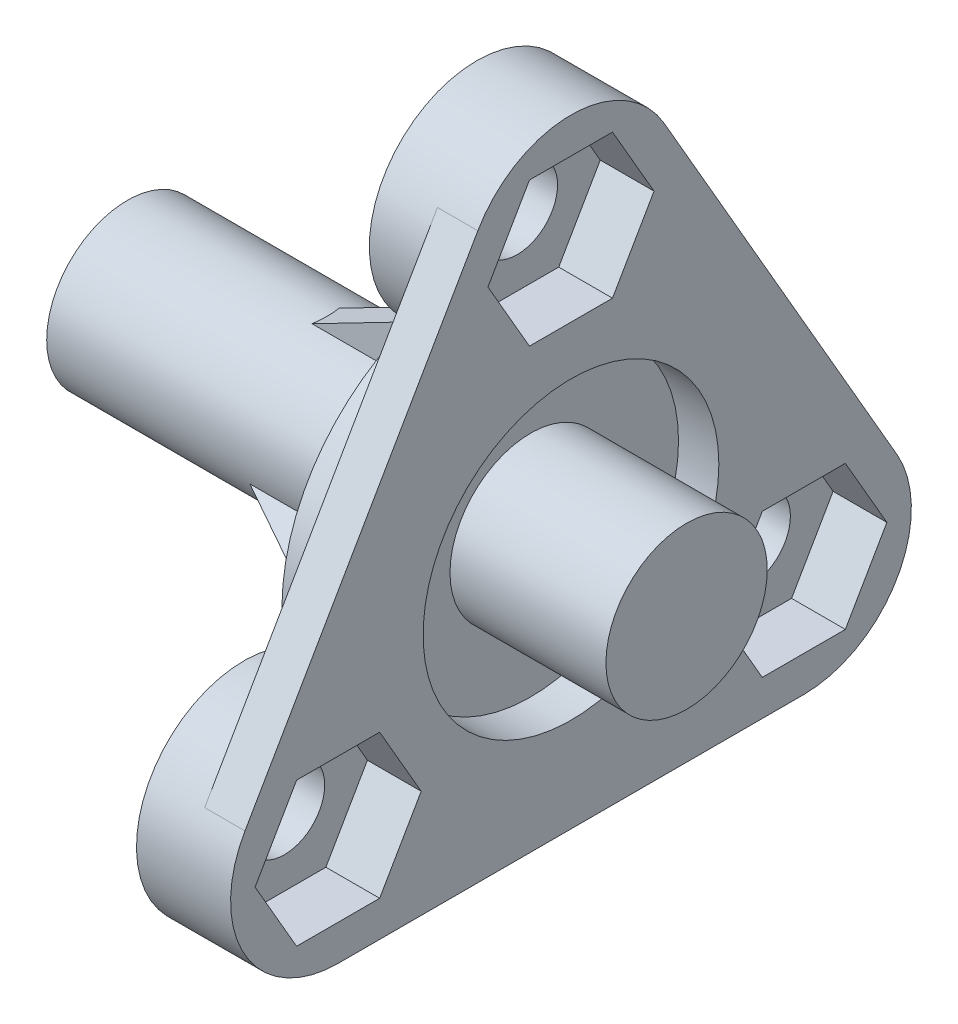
ISO-10303-21;
HEADER;
FILE_DESCRIPTION(('STEP AP214'),'2;1');
FILE_NAME('part.step','',(''),(''),'','','');
FILE_SCHEMA(('AUTOMOTIVE_DESIGN { 1 0 10303 214 1 1 1 1 }'));
ENDSEC;
DATA;
#1=APPLICATION_CONTEXT('core data for automotive mechanical design processes');
#2=APPLICATION_PROTOCOL_DEFINITION('international standard','automotive_design',2000,#1);
#3=PRODUCT_CONTEXT('',#1,'mechanical');
#4=PRODUCT('Part','Part','',(#3));
#5=PRODUCT_RELATED_PRODUCT_CATEGORY('part','',(#4));
#6=PRODUCT_DEFINITION_FORMATION('','',#4);
#7=PRODUCT_DEFINITION_CONTEXT('part definition',#1,'design');
#8=PRODUCT_DEFINITION('design','',#6,#7);
#9=PRODUCT_DEFINITION_SHAPE('','',#8);
#10=(LENGTH_UNIT() NAMED_UNIT(*) SI_UNIT(.MILLI.,.METRE.));
#11=(NAMED_UNIT(*) PLANE_ANGLE_UNIT() SI_UNIT($,.RADIAN.));
#12=(NAMED_UNIT(*) SI_UNIT($,.STERADIAN.) SOLID_ANGLE_UNIT());
#13=UNCERTAINTY_MEASURE_WITH_UNIT(LENGTH_MEASURE(1.E-05),#10,'distance_accuracy_value','');
#14=(GEOMETRIC_REPRESENTATION_CONTEXT(3) GLOBAL_UNCERTAINTY_ASSIGNED_CONTEXT((#13)) GLOBAL_UNIT_ASSIGNED_CONTEXT((#10,
#11,#12)) REPRESENTATION_CONTEXT('',''));
#15=CARTESIAN_POINT('',(0.,0.,0.));
#16=DIRECTION('',(0.,0.,1.));
#17=DIRECTION('',(1.,0.,0.));
#18=AXIS2_PLACEMENT_3D('',#15,#16,#17);
#19=CARTESIAN_POINT('',(1.5,-5.00000000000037,8.66025403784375));
#20=DIRECTION('',(-1.,0.,0.));
#21=DIRECTION('',(0.,0.,1.));
#22=AXIS2_PLACEMENT_3D('',#19,#20,#21);
#23=CYLINDRICAL_SURFACE('',#22,1.50000000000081);
#24=CARTESIAN_POINT('',(-2.,-5.00000000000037,8.66025403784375));
#25=DIRECTION('',(-1.,0.,0.));
#26=DIRECTION('',(0.,0.,1.));
#27=AXIS2_PLACEMENT_3D('',#24,#25,#26);
#28=CIRCLE('',#27,1.50000000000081);
#29=CARTESIAN_POINT('',(-2.,-5.00000000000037,10.1602540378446));
#30=VERTEX_POINT('',#29);
#31=EDGE_CURVE('E498',#30,#30,#28,.T.);
#32=ORIENTED_EDGE('',*,*,#31,.T.);
#33=EDGE_LOOP('',(#32));
#34=FACE_BOUND('',#33,.T.);
#35=CARTESIAN_POINT('',(-0.5,-5.00000000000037,8.66025403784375));
#36=DIRECTION('',(1.,0.,0.));
#37=DIRECTION('',(0.,0.,-1.));
#38=AXIS2_PLACEMENT_3D('',#35,#36,#37);
#39=CIRCLE('',#38,1.50000000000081);
#40=CARTESIAN_POINT('',(-0.5,-5.00000000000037,7.16025403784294));
#41=VERTEX_POINT('',#40);
#42=EDGE_CURVE('E376',#41,#41,#39,.T.);
#43=ORIENTED_EDGE('',*,*,#42,.T.);
#44=EDGE_LOOP('',(#43));
#45=FACE_BOUND('',#44,.T.);
#46=ADVANCED_FACE('F35',(#34,#45),#23,.F.);
#47=CARTESIAN_POINT('',(1.5,-4.99999999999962,-8.66025403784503));
#48=DIRECTION('',(-1.,0.,0.));
#49=DIRECTION('',(0.,0.,1.));
#50=AXIS2_PLACEMENT_3D('',#47,#48,#49);
#51=CYLINDRICAL_SURFACE('',#50,1.50000000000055);
#52=CARTESIAN_POINT('',(-2.,-4.99999999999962,-8.66025403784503));
#53=DIRECTION('',(-1.,0.,0.));
#54=DIRECTION('',(0.,0.,1.));
#55=AXIS2_PLACEMENT_3D('',#52,#53,#54);
#56=CIRCLE('',#55,1.50000000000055);
#57=CARTESIAN_POINT('',(-2.,-4.99999999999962,-7.16025403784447));
#58=VERTEX_POINT('',#57);
#59=EDGE_CURVE('E492',#58,#58,#56,.T.);
#60=ORIENTED_EDGE('',*,*,#59,.T.);
#61=EDGE_LOOP('',(#60));
#62=FACE_BOUND('',#61,.T.);
#63=CARTESIAN_POINT('',(-0.5,-4.99999999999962,-8.66025403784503));
#64=DIRECTION('',(1.,0.,0.));
#65=DIRECTION('',(0.,0.,-1.));
#66=AXIS2_PLACEMENT_3D('',#63,#64,#65);
#67=CIRCLE('',#66,1.50000000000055);
#68=CARTESIAN_POINT('',(-0.5,-4.99999999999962,-10.1602540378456));
#69=VERTEX_POINT('',#68);
#70=EDGE_CURVE('E425',#69,#69,#67,.T.);
#71=ORIENTED_EDGE('',*,*,#70,.T.);
#72=EDGE_LOOP('',(#71));
#73=FACE_BOUND('',#72,.T.);
#74=ADVANCED_FACE('F662',(#62,#73),#51,.F.);
#75=CARTESIAN_POINT('',(1.5,10.,0.));
#76=DIRECTION('',(-1.,0.,0.));
#77=DIRECTION('',(0.,0.,1.));
#78=AXIS2_PLACEMENT_3D('',#75,#76,#77);
#79=CYLINDRICAL_SURFACE('',#78,1.5);
#80=CARTESIAN_POINT('',(-2.,10.,0.));
#81=DIRECTION('',(-1.,0.,0.));
#82=DIRECTION('',(0.,0.,1.));
#83=AXIS2_PLACEMENT_3D('',#80,#81,#82);
#84=CIRCLE('',#83,1.5);
#85=CARTESIAN_POINT('',(-2.,10.,1.5));
#86=VERTEX_POINT('',#85);
#87=EDGE_CURVE('E504',#86,#86,#84,.T.);
#88=ORIENTED_EDGE('',*,*,#87,.T.);
#89=EDGE_LOOP('',(#88));
#90=FACE_BOUND('',#89,.T.);
#91=CARTESIAN_POINT('',(-0.5,10.,0.));
#92=DIRECTION('',(1.,0.,0.));
#93=DIRECTION('',(0.,0.,-1.));
#94=AXIS2_PLACEMENT_3D('',#91,#92,#93);
#95=CIRCLE('',#94,1.5);
#96=CARTESIAN_POINT('',(-0.5,10.,-1.5));
#97=VERTEX_POINT('',#96);
#98=EDGE_CURVE('E474',#97,#97,#95,.T.);
#99=ORIENTED_EDGE('',*,*,#98,.T.);
#100=EDGE_LOOP('',(#99));
#101=FACE_BOUND('',#100,.T.);
#102=ADVANCED_FACE('F668',(#90,#101),#79,.F.);
#103=CARTESIAN_POINT('',(-2.,-2.49999999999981,-4.33012701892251));
#104=DIRECTION('',(-1.,0.,0.));
#105=DIRECTION('',(0.,0.,1.));
#106=AXIS2_PLACEMENT_3D('',#103,#104,#105);
#107=PLANE('',#106);
#108=DIRECTION('',(0.,-0.499999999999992,-0.866025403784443));
#109=VECTOR('',#108,1.);
#110=CARTESIAN_POINT('',(-2.,-2.50060353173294,-5.33117236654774));
#111=LINE('',#110,#109);
#112=CARTESIAN_POINT('',(-2.,-1.04600724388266,-2.81173769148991));
#113=VERTEX_POINT('',#112);
#114=CARTESIAN_POINT('',(-2.,-2.50060353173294,-5.33117236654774));
#115=VERTEX_POINT('',#114);
#116=EDGE_CURVE('E299',#113,#115,#111,.T.);
#117=ORIENTED_EDGE('',*,*,#116,.F.);
#118=CARTESIAN_POINT('',(-2.,0.,0.));
#119=DIRECTION('',(-1.,0.,0.));
#120=DIRECTION('',(0.,0.,1.));
#121=AXIS2_PLACEMENT_3D('',#118,#119,#120);
#122=CIRCLE('',#121,3.);
#123=CARTESIAN_POINT('',(-2.,2.95803989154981,-0.5));
#124=VERTEX_POINT('',#123);
#125=EDGE_CURVE('E493',#124,#113,#122,.T.);
#126=ORIENTED_EDGE('',*,*,#125,.F.);
#127=DIRECTION('',(0.,1.,0.));
#128=VECTOR('',#127,1.);
#129=CARTESIAN_POINT('',(-2.,5.86723246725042,-0.5));
#130=LINE('',#129,#128);
#131=CARTESIAN_POINT('',(-2.,5.86723246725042,-0.5));
#132=VERTEX_POINT('',#131);
#133=EDGE_CURVE('E321',#124,#132,#130,.T.);
#134=ORIENTED_EDGE('',*,*,#133,.T.);
#135=DIRECTION('',(0.,0.,-1.));
#136=VECTOR('',#135,1.);
#137=CARTESIAN_POINT('',(-2.,5.86723246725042,0.5));
#138=LINE('',#137,#136);
#139=CARTESIAN_POINT('',(-2.,5.86723246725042,0.5));
#140=VERTEX_POINT('',#139);
#141=EDGE_CURVE('E329',#140,#132,#138,.T.);
#142=ORIENTED_EDGE('',*,*,#141,.F.);
#143=DIRECTION('',(0.,1.,0.));
#144=VECTOR('',#143,1.);
#145=CARTESIAN_POINT('',(-2.,5.86723246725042,0.5));
#146=LINE('',#145,#144);
#147=CARTESIAN_POINT('',(-2.,2.95803989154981,0.5));
#148=VERTEX_POINT('',#147);
#149=EDGE_CURVE('E322',#148,#140,#146,.T.);
#150=ORIENTED_EDGE('',*,*,#149,.F.);
#151=CARTESIAN_POINT('',(-2.,-1.0460072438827,2.8117376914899));
#152=VERTEX_POINT('',#151);
#153=EDGE_CURVE('E488',#152,#148,#122,.T.);
#154=ORIENTED_EDGE('',*,*,#153,.F.);
#155=DIRECTION('',(0.,-0.500000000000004,0.866025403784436));
#156=VECTOR('',#155,1.);
#157=CARTESIAN_POINT('',(-2.,-2.50060353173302,5.33117236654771));
#158=LINE('',#157,#156);
#159=CARTESIAN_POINT('',(-2.,-2.50060353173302,5.33117236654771));
#160=VERTEX_POINT('',#159);
#161=EDGE_CURVE('E307',#152,#160,#158,.T.);
#162=ORIENTED_EDGE('',*,*,#161,.T.);
#163=DIRECTION('',(0.,0.866025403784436,0.500000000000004));
#164=VECTOR('',#163,1.);
#165=CARTESIAN_POINT('',(-2.,-3.36662893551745,4.8311723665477));
#166=LINE('',#165,#164);
#167=CARTESIAN_POINT('',(-2.,-3.36662893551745,4.8311723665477));
#168=VERTEX_POINT('',#167);
#169=EDGE_CURVE('E315',#168,#160,#166,.T.);
#170=ORIENTED_EDGE('',*,*,#169,.F.);
#171=DIRECTION('',(0.,-0.500000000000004,0.866025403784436));
#172=VECTOR('',#171,1.);
#173=CARTESIAN_POINT('',(-2.,-3.36662893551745,4.8311723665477));
#174=LINE('',#173,#172);
#175=CARTESIAN_POINT('',(-2.,-1.91203264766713,2.31173769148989));
#176=VERTEX_POINT('',#175);
#177=EDGE_CURVE('E308',#176,#168,#174,.T.);
#178=ORIENTED_EDGE('',*,*,#177,.F.);
#179=CARTESIAN_POINT('',(-2.,-1.9120326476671,-2.31173769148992));
#180=VERTEX_POINT('',#179);
#181=EDGE_CURVE('E495',#180,#176,#122,.T.);
#182=ORIENTED_EDGE('',*,*,#181,.F.);
#183=DIRECTION('',(0.,-0.499999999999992,-0.866025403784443));
#184=VECTOR('',#183,1.);
#185=CARTESIAN_POINT('',(-2.,-3.36662893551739,-4.83117236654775));
#186=LINE('',#185,#184);
#187=CARTESIAN_POINT('',(-2.,-3.36662893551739,-4.83117236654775));
#188=VERTEX_POINT('',#187);
#189=EDGE_CURVE('E55',#180,#188,#186,.T.);
#190=ORIENTED_EDGE('',*,*,#189,.T.);
#191=DIRECTION('',(0.,-0.866025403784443,0.499999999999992));
#192=VECTOR('',#191,1.);
#193=CARTESIAN_POINT('',(-2.,-2.50060353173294,-5.33117236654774));
#194=LINE('',#193,#192);
#195=EDGE_CURVE('E50',#115,#188,#194,.T.);
#196=ORIENTED_EDGE('',*,*,#195,.F.);
#197=EDGE_LOOP('',(#117,#126,#134,#142,#150,#154,#162,#170,#178,#182,#190,#196));
#198=FACE_BOUND('',#197,.T.);
#199=ORIENTED_EDGE('',*,*,#59,.F.);
#200=EDGE_LOOP('',(#199));
#201=FACE_BOUND('',#200,.T.);
#202=CARTESIAN_POINT('',(-2.,0.,0.));
#203=DIRECTION('',(-1.,0.,0.));
#204=DIRECTION('',(0.,0.,1.));
#205=AXIS2_PLACEMENT_3D('',#202,#203,#204);
#206=CIRCLE('',#205,7.25);
#207=CARTESIAN_POINT('',(-2.,6.828125,-2.43704923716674));
#208=VERTEX_POINT('',#207);
#209=CARTESIAN_POINT('',(-2.,-1.30351595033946,-7.13185432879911));
#210=VERTEX_POINT('',#209);
#211=EDGE_CURVE('E508',#208,#210,#206,.T.);
#212=ORIENTED_EDGE('',*,*,#211,.T.);
#213=CARTESIAN_POINT('',(-2.,-4.99999999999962,-8.66025403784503));
#214=DIRECTION('',(-1.,0.,0.));
#215=DIRECTION('',(0.,0.,1.));
#216=AXIS2_PLACEMENT_3D('',#213,#214,#215);
#217=CIRCLE('',#216,4.00000000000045);
#218=CARTESIAN_POINT('',(-2.,-5.5246090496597,-4.69480509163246));
#219=VERTEX_POINT('',#218);
#220=EDGE_CURVE('E511',#210,#219,#217,.T.);
#221=ORIENTED_EDGE('',*,*,#220,.T.);
#222=CARTESIAN_POINT('',(-2.,0.,0.));
#223=DIRECTION('',(-1.,0.,0.));
#224=DIRECTION('',(0.,0.,1.));
#225=AXIS2_PLACEMENT_3D('',#222,#223,#224);
#226=CIRCLE('',#225,7.25);
#227=CARTESIAN_POINT('',(-2.,-5.52460904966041,4.69480509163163));
#228=VERTEX_POINT('',#227);
#229=EDGE_CURVE('E514',#219,#228,#226,.T.);
#230=ORIENTED_EDGE('',*,*,#229,.T.);
#231=CARTESIAN_POINT('',(-2.,-5.00000000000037,8.66025403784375));
#232=DIRECTION('',(-1.,0.,0.));
#233=DIRECTION('',(0.,0.,1.));
#234=AXIS2_PLACEMENT_3D('',#231,#232,#233);
#235=CIRCLE('',#234,4.);
#236=CARTESIAN_POINT('',(-2.,-1.30351595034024,7.13185432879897));
#237=VERTEX_POINT('',#236);
#238=EDGE_CURVE('E516',#228,#237,#235,.T.);
#239=ORIENTED_EDGE('',*,*,#238,.T.);
#240=CARTESIAN_POINT('',(-2.,0.,0.));
#241=DIRECTION('',(-1.,0.,0.));
#242=DIRECTION('',(0.,0.,1.));
#243=AXIS2_PLACEMENT_3D('',#240,#241,#242);
#244=CIRCLE('',#243,7.25);
#245=CARTESIAN_POINT('',(-2.,6.828125,2.43704923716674));
#246=VERTEX_POINT('',#245);
#247=EDGE_CURVE('E518',#237,#246,#244,.T.);
#248=ORIENTED_EDGE('',*,*,#247,.T.);
#249=CARTESIAN_POINT('',(-2.,10.,0.));
#250=DIRECTION('',(-1.,0.,0.));
#251=DIRECTION('',(0.,0.,1.));
#252=AXIS2_PLACEMENT_3D('',#249,#250,#251);
#253=CIRCLE('',#252,4.);
#254=EDGE_CURVE('E520',#246,#208,#253,.T.);
#255=ORIENTED_EDGE('',*,*,#254,.T.);
#256=EDGE_LOOP('',(#212,#221,#230,#239,#248,#255));
#257=FACE_BOUND('',#256,.T.);
#258=ORIENTED_EDGE('',*,*,#87,.F.);
#259=EDGE_LOOP('',(#258));
#260=FACE_BOUND('',#259,.T.);
#261=ORIENTED_EDGE('',*,*,#31,.F.);
#262=EDGE_LOOP('',(#261));
#263=FACE_BOUND('',#262,.T.);
#264=ADVANCED_FACE('F633',(#198,#201,#257,#260,#263),#107,.T.);
#265=CARTESIAN_POINT('',(0.,10.,0.));
#266=DIRECTION('',(1.,0.,0.));
#267=DIRECTION('',(0.,0.,-1.));
#268=AXIS2_PLACEMENT_3D('',#265,#266,#267);
#269=PLANE('',#268);
#270=CARTESIAN_POINT('',(0.,10.,0.));
#271=DIRECTION('',(-1.,0.,0.));
#272=DIRECTION('',(0.,0.,1.));
#273=AXIS2_PLACEMENT_3D('',#270,#271,#272);
#274=CIRCLE('',#273,4.);
#275=CARTESIAN_POINT('',(0.,6.828125,2.43704923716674));
#276=VERTEX_POINT('',#275);
#277=CARTESIAN_POINT('',(0.,11.9999999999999,3.46410161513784));
#278=VERTEX_POINT('',#277);
#279=EDGE_CURVE('E512',#276,#278,#274,.T.);
#280=ORIENTED_EDGE('',*,*,#279,.F.);
#281=CARTESIAN_POINT('',(0.,0.,0.));
#282=DIRECTION('',(-1.,0.,0.));
#283=DIRECTION('',(0.,0.,1.));
#284=AXIS2_PLACEMENT_3D('',#281,#282,#283);
#285=CIRCLE('',#284,7.25);
#286=CARTESIAN_POINT('',(0.,-1.30351595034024,7.13185432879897));
#287=VERTEX_POINT('',#286);
#288=EDGE_CURVE('E530',#287,#276,#285,.T.);
#289=ORIENTED_EDGE('',*,*,#288,.F.);
#290=CARTESIAN_POINT('',(0.,-5.00000000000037,8.66025403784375));
#291=DIRECTION('',(-1.,0.,0.));
#292=DIRECTION('',(0.,0.,1.));
#293=AXIS2_PLACEMENT_3D('',#290,#291,#292);
#294=CIRCLE('',#293,4.);
#295=CARTESIAN_POINT('',(0.,-3.00000000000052,12.1243556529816));
#296=VERTEX_POINT('',#295);
#297=EDGE_CURVE('E568',#296,#287,#294,.T.);
#298=ORIENTED_EDGE('',*,*,#297,.F.);
#299=DIRECTION('',(0.,-0.86602540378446,0.499999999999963));
#300=VECTOR('',#299,1.);
#301=CARTESIAN_POINT('',(0.,11.9999999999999,3.46410161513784));
#302=LINE('',#301,#300);
#303=EDGE_CURVE('E578',#278,#296,#302,.T.);
#304=ORIENTED_EDGE('',*,*,#303,.F.);
#305=EDGE_LOOP('',(#280,#289,#298,#304));
#306=FACE_BOUND('',#305,.T.);
#307=ADVANCED_FACE('F694',(#306),#269,.F.);
#308=CARTESIAN_POINT('',(0.,12.0000000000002,-3.46410161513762));
#309=VERTEX_POINT('',#308);
#310=CARTESIAN_POINT('',(0.,6.828125,-2.43704923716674));
#311=VERTEX_POINT('',#310);
#312=EDGE_CURVE('E564',#309,#311,#274,.T.);
#313=ORIENTED_EDGE('',*,*,#312,.F.);
#314=DIRECTION('',(0.,0.866025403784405,0.500000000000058));
#315=VECTOR('',#314,1.);
#316=CARTESIAN_POINT('',(0.,-2.99999999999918,-12.124355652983));
#317=LINE('',#316,#315);
#318=CARTESIAN_POINT('',(0.,-2.99999999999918,-12.124355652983));
#319=VERTEX_POINT('',#318);
#320=EDGE_CURVE('E742',#319,#309,#317,.T.);
#321=ORIENTED_EDGE('',*,*,#320,.F.);
#322=CARTESIAN_POINT('',(0.,-4.99999999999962,-8.66025403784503));
#323=DIRECTION('',(-1.,0.,0.));
#324=DIRECTION('',(0.,0.,1.));
#325=AXIS2_PLACEMENT_3D('',#322,#323,#324);
#326=CIRCLE('',#325,4.00000000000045);
#327=CARTESIAN_POINT('',(0.,-1.30351595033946,-7.13185432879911));
#328=VERTEX_POINT('',#327);
#329=EDGE_CURVE('E525',#328,#319,#326,.T.);
#330=ORIENTED_EDGE('',*,*,#329,.F.);
#331=CARTESIAN_POINT('',(0.,0.,0.));
#332=DIRECTION('',(-1.,0.,0.));
#333=DIRECTION('',(0.,0.,1.));
#334=AXIS2_PLACEMENT_3D('',#331,#332,#333);
#335=CIRCLE('',#334,7.25);
#336=EDGE_CURVE('E507',#311,#328,#335,.T.);
#337=ORIENTED_EDGE('',*,*,#336,.F.);
#338=EDGE_LOOP('',(#313,#321,#330,#337));
#339=FACE_BOUND('',#338,.T.);
#340=ADVANCED_FACE('F689',(#339),#269,.F.);
#341=CARTESIAN_POINT('',(1.5,10.,0.));
#342=DIRECTION('',(1.,0.,0.));
#343=DIRECTION('',(0.,0.,-1.));
#344=AXIS2_PLACEMENT_3D('',#341,#342,#343);
#345=PLANE('',#344);
#346=DIRECTION('',(0.,0.866025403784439,-0.5));
#347=VECTOR('',#346,1.);
#348=CARTESIAN_POINT('',(1.5,-7.67500000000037,7.1158420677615));
#349=LINE('',#348,#347);
#350=CARTESIAN_POINT('',(1.5,-7.67500000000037,7.1158420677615));
#351=VERTEX_POINT('',#350);
#352=CARTESIAN_POINT('',(1.5,-5.00000000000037,5.57143009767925));
#353=VERTEX_POINT('',#352);
#354=EDGE_CURVE('E338',#351,#353,#349,.T.);
#355=ORIENTED_EDGE('',*,*,#354,.F.);
#356=DIRECTION('',(0.,0.,-1.));
#357=VECTOR('',#356,1.);
#358=CARTESIAN_POINT('',(1.5,-7.67500000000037,10.204666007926));
#359=LINE('',#358,#357);
#360=CARTESIAN_POINT('',(1.5,-7.67500000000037,10.204666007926));
#361=VERTEX_POINT('',#360);
#362=EDGE_CURVE('E343',#361,#351,#359,.T.);
#363=ORIENTED_EDGE('',*,*,#362,.F.);
#364=DIRECTION('',(0.,-0.866025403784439,-0.5));
#365=VECTOR('',#364,1.);
#366=CARTESIAN_POINT('',(1.5,-5.00000000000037,11.7490779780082));
#367=LINE('',#366,#365);
#368=CARTESIAN_POINT('',(1.5,-5.00000000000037,11.7490779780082));
#369=VERTEX_POINT('',#368);
#370=EDGE_CURVE('E369',#369,#361,#367,.T.);
#371=ORIENTED_EDGE('',*,*,#370,.F.);
#372=DIRECTION('',(0.,-0.866025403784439,0.5));
#373=VECTOR('',#372,1.);
#374=CARTESIAN_POINT('',(1.5,-2.32500000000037,10.204666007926));
#375=LINE('',#374,#373);
#376=CARTESIAN_POINT('',(1.5,-2.32500000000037,10.204666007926));
#377=VERTEX_POINT('',#376);
#378=EDGE_CURVE('E366',#377,#369,#375,.T.);
#379=ORIENTED_EDGE('',*,*,#378,.F.);
#380=DIRECTION('',(0.,0.,1.));
#381=VECTOR('',#380,1.);
#382=CARTESIAN_POINT('',(1.5,-2.32500000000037,7.1158420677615));
#383=LINE('',#382,#381);
#384=CARTESIAN_POINT('',(1.5,-2.32500000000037,7.1158420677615));
#385=VERTEX_POINT('',#384);
#386=EDGE_CURVE('E363',#385,#377,#383,.T.);
#387=ORIENTED_EDGE('',*,*,#386,.F.);
#388=DIRECTION('',(0.,0.866025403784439,0.5));
#389=VECTOR('',#388,1.);
#390=CARTESIAN_POINT('',(1.5,-5.00000000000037,5.57143009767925));
#391=LINE('',#390,#389);
#392=EDGE_CURVE('E360',#353,#385,#391,.T.);
#393=ORIENTED_EDGE('',*,*,#392,.F.);
#394=EDGE_LOOP('',(#355,#363,#371,#379,#387,#393));
#395=FACE_BOUND('',#394,.T.);
#396=DIRECTION('',(0.,0.866025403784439,-0.499999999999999));
#397=VECTOR('',#396,1.);
#398=CARTESIAN_POINT('',(1.5,-7.67499999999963,-10.2046660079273));
#399=LINE('',#398,#397);
#400=CARTESIAN_POINT('',(1.5,-7.67499999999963,-10.2046660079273));
#401=VERTEX_POINT('',#400);
#402=CARTESIAN_POINT('',(1.5,-4.99999999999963,-11.7490779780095));
#403=VERTEX_POINT('',#402);
#404=EDGE_CURVE('E407',#401,#403,#399,.T.);
#405=ORIENTED_EDGE('',*,*,#404,.F.);
#406=DIRECTION('',(0.,0.,-1.));
#407=VECTOR('',#406,1.);
#408=CARTESIAN_POINT('',(1.5,-7.67499999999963,-7.11584206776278));
#409=LINE('',#408,#407);
#410=CARTESIAN_POINT('',(1.5,-7.67499999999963,-7.11584206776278));
#411=VERTEX_POINT('',#410);
#412=EDGE_CURVE('E391',#411,#401,#409,.T.);
#413=ORIENTED_EDGE('',*,*,#412,.F.);
#414=DIRECTION('',(0.,-0.866025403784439,-0.5));
#415=VECTOR('',#414,1.);
#416=CARTESIAN_POINT('',(1.5,-4.99999999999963,-5.57143009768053));
#417=LINE('',#416,#415);
#418=CARTESIAN_POINT('',(1.5,-4.99999999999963,-5.57143009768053));
#419=VERTEX_POINT('',#418);
#420=EDGE_CURVE('E418',#419,#411,#417,.T.);
#421=ORIENTED_EDGE('',*,*,#420,.F.);
#422=DIRECTION('',(0.,-0.866025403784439,0.5));
#423=VECTOR('',#422,1.);
#424=CARTESIAN_POINT('',(1.5,-2.32499999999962,-7.11584206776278));
#425=LINE('',#424,#423);
#426=CARTESIAN_POINT('',(1.5,-2.32499999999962,-7.11584206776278));
#427=VERTEX_POINT('',#426);
#428=EDGE_CURVE('E415',#427,#419,#425,.T.);
#429=ORIENTED_EDGE('',*,*,#428,.F.);
#430=DIRECTION('',(0.,0.,1.));
#431=VECTOR('',#430,1.);
#432=CARTESIAN_POINT('',(1.5,-2.32499999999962,-10.2046660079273));
#433=LINE('',#432,#431);
#434=CARTESIAN_POINT('',(1.5,-2.32499999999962,-10.2046660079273));
#435=VERTEX_POINT('',#434);
#436=EDGE_CURVE('E412',#435,#427,#433,.T.);
#437=ORIENTED_EDGE('',*,*,#436,.F.);
#438=DIRECTION('',(0.,0.866025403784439,0.5));
#439=VECTOR('',#438,1.);
#440=CARTESIAN_POINT('',(1.5,-4.99999999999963,-11.7490779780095));
#441=LINE('',#440,#439);
#442=EDGE_CURVE('E409',#403,#435,#441,.T.);
#443=ORIENTED_EDGE('',*,*,#442,.F.);
#444=EDGE_LOOP('',(#405,#413,#421,#429,#437,#443));
#445=FACE_BOUND('',#444,.T.);
#446=DIRECTION('',(0.,0.866025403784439,-0.5));
#447=VECTOR('',#446,1.);
#448=CARTESIAN_POINT('',(1.5,7.325,-1.54441197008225));
#449=LINE('',#448,#447);
#450=CARTESIAN_POINT('',(1.5,7.325,-1.54441197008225));
#451=VERTEX_POINT('',#450);
#452=CARTESIAN_POINT('',(1.5,10.,-3.0888239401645));
#453=VERTEX_POINT('',#452);
#454=EDGE_CURVE('E456',#451,#453,#449,.T.);
#455=ORIENTED_EDGE('',*,*,#454,.F.);
#456=DIRECTION('',(0.,0.,-1.));
#457=VECTOR('',#456,1.);
#458=CARTESIAN_POINT('',(1.5,7.325,1.54441197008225));
#459=LINE('',#458,#457);
#460=CARTESIAN_POINT('',(1.5,7.325,1.54441197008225));
#461=VERTEX_POINT('',#460);
#462=EDGE_CURVE('E440',#461,#451,#459,.T.);
#463=ORIENTED_EDGE('',*,*,#462,.F.);
#464=DIRECTION('',(0.,-0.866025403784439,-0.5));
#465=VECTOR('',#464,1.);
#466=CARTESIAN_POINT('',(1.5,10.,3.0888239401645));
#467=LINE('',#466,#465);
#468=CARTESIAN_POINT('',(1.5,10.,3.0888239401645));
#469=VERTEX_POINT('',#468);
#470=EDGE_CURVE('E467',#469,#461,#467,.T.);
#471=ORIENTED_EDGE('',*,*,#470,.F.);
#472=DIRECTION('',(0.,-0.866025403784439,0.5));
#473=VECTOR('',#472,1.);
#474=CARTESIAN_POINT('',(1.5,12.675,1.54441197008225));
#475=LINE('',#474,#473);
#476=CARTESIAN_POINT('',(1.5,12.675,1.54441197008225));
#477=VERTEX_POINT('',#476);
#478=EDGE_CURVE('E464',#477,#469,#475,.T.);
#479=ORIENTED_EDGE('',*,*,#478,.F.);
#480=DIRECTION('',(0.,0.,1.));
#481=VECTOR('',#480,1.);
#482=CARTESIAN_POINT('',(1.5,12.675,-1.54441197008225));
#483=LINE('',#482,#481);
#484=CARTESIAN_POINT('',(1.5,12.675,-1.54441197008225));
#485=VERTEX_POINT('',#484);
#486=EDGE_CURVE('E461',#485,#477,#483,.T.);
#487=ORIENTED_EDGE('',*,*,#486,.F.);
#488=DIRECTION('',(0.,0.866025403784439,0.5));
#489=VECTOR('',#488,1.);
#490=CARTESIAN_POINT('',(1.5,10.,-3.0888239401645));
#491=LINE('',#490,#489);
#492=EDGE_CURVE('E458',#453,#485,#491,.T.);
#493=ORIENTED_EDGE('',*,*,#492,.F.);
#494=EDGE_LOOP('',(#455,#463,#471,#479,#487,#493));
#495=FACE_BOUND('',#494,.T.);
#496=CARTESIAN_POINT('',(1.5,0.,0.));
#497=DIRECTION('',(1.,0.,0.));
#498=DIRECTION('',(0.,0.,-1.));
#499=AXIS2_PLACEMENT_3D('',#496,#497,#498);
#500=CIRCLE('',#499,5.5);
#501=CARTESIAN_POINT('',(1.5,0.,-5.5));
#502=VERTEX_POINT('',#501);
#503=EDGE_CURVE('E582',#502,#502,#500,.T.);
#504=ORIENTED_EDGE('',*,*,#503,.F.);
#505=EDGE_LOOP('',(#504));
#506=FACE_BOUND('',#505,.T.);
#507=CARTESIAN_POINT('',(1.5,10.,0.));
#508=DIRECTION('',(1.,0.,0.));
#509=DIRECTION('',(0.,0.,-1.));
#510=AXIS2_PLACEMENT_3D('',#507,#508,#509);
#511=CIRCLE('',#510,4.);
#512=CARTESIAN_POINT('',(1.5,12.0000000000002,-3.46410161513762));
#513=VERTEX_POINT('',#512);
#514=CARTESIAN_POINT('',(1.5,11.9999999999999,3.46410161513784));
#515=VERTEX_POINT('',#514);
#516=EDGE_CURVE('E731',#513,#515,#511,.T.);
#517=ORIENTED_EDGE('',*,*,#516,.T.);
#518=DIRECTION('',(0.,-0.86602540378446,0.499999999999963));
#519=VECTOR('',#518,1.);
#520=CARTESIAN_POINT('',(1.5,11.9999999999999,3.46410161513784));
#521=LINE('',#520,#519);
#522=CARTESIAN_POINT('',(1.5,-3.00000000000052,12.1243556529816));
#523=VERTEX_POINT('',#522);
#524=EDGE_CURVE('E727',#515,#523,#521,.T.);
#525=ORIENTED_EDGE('',*,*,#524,.T.);
#526=CARTESIAN_POINT('',(1.5,-5.00000000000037,8.66025403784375));
#527=DIRECTION('',(1.,0.,0.));
#528=DIRECTION('',(0.,0.,-1.));
#529=AXIS2_PLACEMENT_3D('',#526,#527,#528);
#530=CIRCLE('',#529,4.);
#531=CARTESIAN_POINT('',(1.5,-9.00000000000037,8.66025403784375));
#532=VERTEX_POINT('',#531);
#533=EDGE_CURVE('E722',#523,#532,#530,.T.);
#534=ORIENTED_EDGE('',*,*,#533,.T.);
#535=DIRECTION('',(0.,0.,-1.));
#536=VECTOR('',#535,1.);
#537=CARTESIAN_POINT('',(1.5,-9.00000000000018,-8.66025403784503));
#538=LINE('',#537,#536);
#539=CARTESIAN_POINT('',(1.5,-9.00000000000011,-8.66025403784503));
#540=VERTEX_POINT('',#539);
#541=EDGE_CURVE('E726',#532,#540,#538,.T.);
#542=ORIENTED_EDGE('',*,*,#541,.T.);
#543=CARTESIAN_POINT('',(1.5,-4.99999999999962,-8.66025403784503));
#544=DIRECTION('',(1.,0.,0.));
#545=DIRECTION('',(0.,0.,-1.));
#546=AXIS2_PLACEMENT_3D('',#543,#544,#545);
#547=CIRCLE('',#546,4.00000000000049);
#548=CARTESIAN_POINT('',(1.5,-2.99999999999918,-12.124355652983));
#549=VERTEX_POINT('',#548);
#550=EDGE_CURVE('E729',#540,#549,#547,.T.);
#551=ORIENTED_EDGE('',*,*,#550,.T.);
#552=DIRECTION('',(0.,0.866025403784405,0.500000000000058));
#553=VECTOR('',#552,1.);
#554=CARTESIAN_POINT('',(1.5,-2.99999999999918,-12.124355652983));
#555=LINE('',#554,#553);
#556=EDGE_CURVE('E558',#549,#513,#555,.T.);
#557=ORIENTED_EDGE('',*,*,#556,.T.);
#558=EDGE_LOOP('',(#517,#525,#534,#542,#551,#557));
#559=FACE_BOUND('',#558,.T.);
#560=ADVANCED_FACE('F685',(#395,#445,#495,#506,#559),#345,.T.);
#561=CARTESIAN_POINT('',(0.,-5.52460904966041,4.69480509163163));
#562=VERTEX_POINT('',#561);
#563=CARTESIAN_POINT('',(0.,-9.00000000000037,8.66025403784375));
#564=VERTEX_POINT('',#563);
#565=EDGE_CURVE('E529',#562,#564,#294,.T.);
#566=ORIENTED_EDGE('',*,*,#565,.F.);
#567=CARTESIAN_POINT('',(0.,0.,0.));
#568=DIRECTION('',(-1.,0.,0.));
#569=DIRECTION('',(0.,0.,1.));
#570=AXIS2_PLACEMENT_3D('',#567,#568,#569);
#571=CIRCLE('',#570,7.25);
#572=CARTESIAN_POINT('',(0.,-5.5246090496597,-4.69480509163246));
#573=VERTEX_POINT('',#572);
#574=EDGE_CURVE('E526',#573,#562,#571,.T.);
#575=ORIENTED_EDGE('',*,*,#574,.F.);
#576=CARTESIAN_POINT('',(0.,-9.00000000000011,-8.66025403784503));
#577=VERTEX_POINT('',#576);
#578=EDGE_CURVE('E569',#577,#573,#326,.T.);
#579=ORIENTED_EDGE('',*,*,#578,.F.);
#580=DIRECTION('',(0.,0.,-1.));
#581=VECTOR('',#580,1.);
#582=CARTESIAN_POINT('',(0.,-9.00000000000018,-8.66025403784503));
#583=LINE('',#582,#581);
#584=EDGE_CURVE('E581',#564,#577,#583,.T.);
#585=ORIENTED_EDGE('',*,*,#584,.F.);
#586=EDGE_LOOP('',(#566,#575,#579,#585));
#587=FACE_BOUND('',#586,.T.);
#588=ADVANCED_FACE('F688',(#587),#269,.F.);
#589=CARTESIAN_POINT('',(1.5,10.,0.));
#590=DIRECTION('',(-1.,0.,0.));
#591=DIRECTION('',(0.,0.,1.));
#592=AXIS2_PLACEMENT_3D('',#589,#590,#591);
#593=CYLINDRICAL_SURFACE('',#592,4.);
#594=DIRECTION('',(-1.,0.,0.));
#595=VECTOR('',#594,1.);
#596=CARTESIAN_POINT('',(1.5,12.0000000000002,-3.46410161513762));
#597=LINE('',#596,#595);
#598=EDGE_CURVE('E572',#513,#309,#597,.T.);
#599=ORIENTED_EDGE('',*,*,#598,.T.);
#600=ORIENTED_EDGE('',*,*,#312,.T.);
#601=DIRECTION('',(1.,0.,0.));
#602=VECTOR('',#601,1.);
#603=CARTESIAN_POINT('',(-2.,6.828125,-2.43704923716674));
#604=LINE('',#603,#602);
#605=EDGE_CURVE('E522',#208,#311,#604,.T.);
#606=ORIENTED_EDGE('',*,*,#605,.F.);
#607=ORIENTED_EDGE('',*,*,#254,.F.);
#608=DIRECTION('',(1.,0.,0.));
#609=VECTOR('',#608,1.);
#610=CARTESIAN_POINT('',(-2.,6.828125,2.43704923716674));
#611=LINE('',#610,#609);
#612=EDGE_CURVE('E535',#246,#276,#611,.T.);
#613=ORIENTED_EDGE('',*,*,#612,.T.);
#614=ORIENTED_EDGE('',*,*,#279,.T.);
#615=DIRECTION('',(-1.,0.,0.));
#616=VECTOR('',#615,1.);
#617=CARTESIAN_POINT('',(1.5,11.9999999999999,3.46410161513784));
#618=LINE('',#617,#616);
#619=EDGE_CURVE('E585',#515,#278,#618,.T.);
#620=ORIENTED_EDGE('',*,*,#619,.F.);
#621=ORIENTED_EDGE('',*,*,#516,.F.);
#622=EDGE_LOOP('',(#599,#600,#606,#607,#613,#614,#620,#621));
#623=FACE_BOUND('',#622,.T.);
#624=ADVANCED_FACE('F37',(#623),#593,.T.);
#625=CARTESIAN_POINT('',(1.5,11.9999999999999,3.46410161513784));
#626=DIRECTION('',(0.,-0.499999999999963,-0.86602540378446));
#627=DIRECTION('',(0.,0.86602540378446,-0.499999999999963));
#628=AXIS2_PLACEMENT_3D('',#625,#626,#627);
#629=PLANE('',#628);
#630=ORIENTED_EDGE('',*,*,#303,.T.);
#631=DIRECTION('',(-1.,0.,0.));
#632=VECTOR('',#631,1.);
#633=CARTESIAN_POINT('',(1.5,-3.00000000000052,12.1243556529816));
#634=LINE('',#633,#632);
#635=EDGE_CURVE('E588',#523,#296,#634,.T.);
#636=ORIENTED_EDGE('',*,*,#635,.F.);
#637=ORIENTED_EDGE('',*,*,#524,.F.);
#638=ORIENTED_EDGE('',*,*,#619,.T.);
#639=EDGE_LOOP('',(#630,#636,#637,#638));
#640=FACE_BOUND('',#639,.T.);
#641=ADVANCED_FACE('F708',(#640),#629,.F.);
#642=CARTESIAN_POINT('',(1.5,-5.00000000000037,8.66025403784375));
#643=DIRECTION('',(-1.,0.,0.));
#644=DIRECTION('',(0.,0.,1.));
#645=AXIS2_PLACEMENT_3D('',#642,#643,#644);
#646=CYLINDRICAL_SURFACE('',#645,4.);
#647=ORIENTED_EDGE('',*,*,#635,.T.);
#648=ORIENTED_EDGE('',*,*,#297,.T.);
#649=DIRECTION('',(1.,0.,0.));
#650=VECTOR('',#649,1.);
#651=CARTESIAN_POINT('',(-2.,-1.30351595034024,7.13185432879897));
#652=LINE('',#651,#650);
#653=EDGE_CURVE('E538',#237,#287,#652,.T.);
#654=ORIENTED_EDGE('',*,*,#653,.F.);
#655=ORIENTED_EDGE('',*,*,#238,.F.);
#656=DIRECTION('',(1.,0.,0.));
#657=VECTOR('',#656,1.);
#658=CARTESIAN_POINT('',(-2.,-5.52460904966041,4.69480509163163));
#659=LINE('',#658,#657);
#660=EDGE_CURVE('E541',#228,#562,#659,.T.);
#661=ORIENTED_EDGE('',*,*,#660,.T.);
#662=ORIENTED_EDGE('',*,*,#565,.T.);
#663=DIRECTION('',(-1.,0.,0.));
#664=VECTOR('',#663,1.);
#665=CARTESIAN_POINT('',(1.5,-9.00000000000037,8.66025403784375));
#666=LINE('',#665,#664);
#667=EDGE_CURVE('E596',#532,#564,#666,.T.);
#668=ORIENTED_EDGE('',*,*,#667,.F.);
#669=ORIENTED_EDGE('',*,*,#533,.F.);
#670=EDGE_LOOP('',(#647,#648,#654,#655,#661,#662,#668,#669));
#671=FACE_BOUND('',#670,.T.);
#672=ADVANCED_FACE('F705',(#671),#646,.T.);
#673=CARTESIAN_POINT('',(1.5,-9.00000000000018,-8.66025403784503));
#674=DIRECTION('',(0.,1.,0.));
#675=DIRECTION('',(0.,0.,1.));
#676=AXIS2_PLACEMENT_3D('',#673,#674,#675);
#677=PLANE('',#676);
#678=ORIENTED_EDGE('',*,*,#584,.T.);
#679=DIRECTION('',(-1.,0.,0.));
#680=VECTOR('',#679,1.);
#681=CARTESIAN_POINT('',(1.5,-9.00000000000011,-8.66025403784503));
#682=LINE('',#681,#680);
#683=EDGE_CURVE('E600',#540,#577,#682,.T.);
#684=ORIENTED_EDGE('',*,*,#683,.F.);
#685=ORIENTED_EDGE('',*,*,#541,.F.);
#686=ORIENTED_EDGE('',*,*,#667,.T.);
#687=EDGE_LOOP('',(#678,#684,#685,#686));
#688=FACE_BOUND('',#687,.T.);
#689=ADVANCED_FACE('F701',(#688),#677,.F.);
#690=CARTESIAN_POINT('',(1.5,-4.99999999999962,-8.66025403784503));
#691=DIRECTION('',(-1.,0.,0.));
#692=DIRECTION('',(0.,0.,1.));
#693=AXIS2_PLACEMENT_3D('',#690,#691,#692);
#694=CYLINDRICAL_SURFACE('',#693,4.00000000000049);
#695=ORIENTED_EDGE('',*,*,#683,.T.);
#696=ORIENTED_EDGE('',*,*,#578,.T.);
#697=DIRECTION('',(1.,0.,0.));
#698=VECTOR('',#697,1.);
#699=CARTESIAN_POINT('',(-2.,-5.5246090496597,-4.69480509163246));
#700=LINE('',#699,#698);
#701=EDGE_CURVE('E544',#219,#573,#700,.T.);
#702=ORIENTED_EDGE('',*,*,#701,.F.);
#703=ORIENTED_EDGE('',*,*,#220,.F.);
#704=DIRECTION('',(1.,0.,0.));
#705=VECTOR('',#704,1.);
#706=CARTESIAN_POINT('',(-2.,-1.30351595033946,-7.13185432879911));
#707=LINE('',#706,#705);
#708=EDGE_CURVE('E547',#210,#328,#707,.T.);
#709=ORIENTED_EDGE('',*,*,#708,.T.);
#710=ORIENTED_EDGE('',*,*,#329,.T.);
#711=DIRECTION('',(-1.,0.,0.));
#712=VECTOR('',#711,1.);
#713=CARTESIAN_POINT('',(1.5,-2.99999999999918,-12.124355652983));
#714=LINE('',#713,#712);
#715=EDGE_CURVE('E575',#549,#319,#714,.T.);
#716=ORIENTED_EDGE('',*,*,#715,.F.);
#717=ORIENTED_EDGE('',*,*,#550,.F.);
#718=EDGE_LOOP('',(#695,#696,#702,#703,#709,#710,#716,#717));
#719=FACE_BOUND('',#718,.T.);
#720=ADVANCED_FACE('F697',(#719),#694,.T.);
#721=CARTESIAN_POINT('',(1.5,-2.99999999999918,-12.124355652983));
#722=DIRECTION('',(0.,-0.500000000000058,0.866025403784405));
#723=DIRECTION('',(0.,-0.866025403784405,-0.500000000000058));
#724=AXIS2_PLACEMENT_3D('',#721,#722,#723);
#725=PLANE('',#724);
#726=ORIENTED_EDGE('',*,*,#320,.T.);
#727=ORIENTED_EDGE('',*,*,#598,.F.);
#728=ORIENTED_EDGE('',*,*,#556,.F.);
#729=ORIENTED_EDGE('',*,*,#715,.T.);
#730=EDGE_LOOP('',(#726,#727,#728,#729));
#731=FACE_BOUND('',#730,.T.);
#732=ADVANCED_FACE('F679',(#731),#725,.F.);
#733=CARTESIAN_POINT('',(1.5,0.,0.));
#734=DIRECTION('',(-1.,0.,0.));
#735=DIRECTION('',(0.,0.,1.));
#736=AXIS2_PLACEMENT_3D('',#733,#734,#735);
#737=CYLINDRICAL_SURFACE('',#736,5.5);
#738=ORIENTED_EDGE('',*,*,#503,.T.);
#739=EDGE_LOOP('',(#738));
#740=FACE_BOUND('',#739,.T.);
#741=CARTESIAN_POINT('',(0.,0.,0.));
#742=DIRECTION('',(1.,0.,0.));
#743=DIRECTION('',(0.,0.,-1.));
#744=AXIS2_PLACEMENT_3D('',#741,#742,#743);
#745=CIRCLE('',#744,5.5);
#746=CARTESIAN_POINT('',(0.,0.,-5.5));
#747=VERTEX_POINT('',#746);
#748=EDGE_CURVE('E550',#747,#747,#745,.T.);
#749=ORIENTED_EDGE('',*,*,#748,.F.);
#750=EDGE_LOOP('',(#749));
#751=FACE_BOUND('',#750,.T.);
#752=ADVANCED_FACE('F676',(#740,#751),#737,.F.);
#753=CARTESIAN_POINT('',(0.,-2.49999999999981,-4.33012701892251));
#754=DIRECTION('',(-1.,0.,0.));
#755=DIRECTION('',(0.,0.,1.));
#756=AXIS2_PLACEMENT_3D('',#753,#754,#755);
#757=PLANE('',#756);
#758=CARTESIAN_POINT('',(0.,0.,0.));
#759=DIRECTION('',(-1.,0.,0.));
#760=DIRECTION('',(0.,0.,1.));
#761=AXIS2_PLACEMENT_3D('',#758,#759,#760);
#762=CIRCLE('',#761,3.);
#763=CARTESIAN_POINT('',(0.,0.,3.));
#764=VERTEX_POINT('',#763);
#765=EDGE_CURVE('E593',#764,#764,#762,.F.);
#766=ORIENTED_EDGE('',*,*,#765,.F.);
#767=EDGE_LOOP('',(#766));
#768=FACE_BOUND('',#767,.T.);
#769=ORIENTED_EDGE('',*,*,#748,.T.);
#770=EDGE_LOOP('',(#769));
#771=FACE_BOUND('',#770,.T.);
#772=ADVANCED_FACE('F678',(#768,#771),#757,.F.);
#773=CARTESIAN_POINT('',(-2.,0.,0.));
#774=DIRECTION('',(1.,0.,0.));
#775=DIRECTION('',(0.,0.,-1.));
#776=AXIS2_PLACEMENT_3D('',#773,#774,#775);
#777=CYLINDRICAL_SURFACE('',#776,7.25);
#778=ORIENTED_EDGE('',*,*,#336,.T.);
#779=ORIENTED_EDGE('',*,*,#708,.F.);
#780=ORIENTED_EDGE('',*,*,#211,.F.);
#781=ORIENTED_EDGE('',*,*,#605,.T.);
#782=EDGE_LOOP('',(#778,#779,#780,#781));
#783=FACE_BOUND('',#782,.T.);
#784=ADVANCED_FACE('F674',(#783),#777,.T.);
#785=CARTESIAN_POINT('',(-2.,0.,0.));
#786=DIRECTION('',(1.,0.,0.));
#787=DIRECTION('',(0.,0.,-1.));
#788=AXIS2_PLACEMENT_3D('',#785,#786,#787);
#789=CYLINDRICAL_SURFACE('',#788,7.25);
#790=ORIENTED_EDGE('',*,*,#574,.T.);
#791=ORIENTED_EDGE('',*,*,#660,.F.);
#792=ORIENTED_EDGE('',*,*,#229,.F.);
#793=ORIENTED_EDGE('',*,*,#701,.T.);
#794=EDGE_LOOP('',(#790,#791,#792,#793));
#795=FACE_BOUND('',#794,.T.);
#796=ADVANCED_FACE('F793',(#795),#789,.T.);
#797=CARTESIAN_POINT('',(-2.,0.,0.));
#798=DIRECTION('',(1.,0.,0.));
#799=DIRECTION('',(0.,0.,-1.));
#800=AXIS2_PLACEMENT_3D('',#797,#798,#799);
#801=CYLINDRICAL_SURFACE('',#800,7.25);
#802=ORIENTED_EDGE('',*,*,#288,.T.);
#803=ORIENTED_EDGE('',*,*,#612,.F.);
#804=ORIENTED_EDGE('',*,*,#247,.F.);
#805=ORIENTED_EDGE('',*,*,#653,.T.);
#806=EDGE_LOOP('',(#802,#803,#804,#805));
#807=FACE_BOUND('',#806,.T.);
#808=ADVANCED_FACE('F776',(#807),#801,.T.);
#809=CARTESIAN_POINT('',(-2.,0.,0.));
#810=DIRECTION('',(1.,0.,0.));
#811=DIRECTION('',(0.,0.,-1.));
#812=AXIS2_PLACEMENT_3D('',#809,#810,#811);
#813=CYLINDRICAL_SURFACE('',#812,1.5);
#814=CARTESIAN_POINT('',(0.,0.,0.));
#815=DIRECTION('',(-1.,0.,0.));
#816=DIRECTION('',(0.,0.,1.));
#817=AXIS2_PLACEMENT_3D('',#814,#815,#816);
#818=CIRCLE('',#817,1.5);
#819=CARTESIAN_POINT('',(0.,0.,1.5));
#820=VERTEX_POINT('',#819);
#821=EDGE_CURVE('E501',#820,#820,#818,.T.);
#822=ORIENTED_EDGE('',*,*,#821,.F.);
#823=EDGE_LOOP('',(#822));
#824=FACE_BOUND('',#823,.T.);
#825=CARTESIAN_POINT('',(-15.,0.,0.));
#826=DIRECTION('',(-1.,0.,0.));
#827=DIRECTION('',(0.,0.,1.));
#828=AXIS2_PLACEMENT_3D('',#825,#826,#827);
#829=CIRCLE('',#828,1.5);
#830=CARTESIAN_POINT('',(-15.,0.,1.5));
#831=VERTEX_POINT('',#830);
#832=EDGE_CURVE('E485',#831,#831,#829,.T.);
#833=ORIENTED_EDGE('',*,*,#832,.T.);
#834=EDGE_LOOP('',(#833));
#835=FACE_BOUND('',#834,.T.);
#836=ADVANCED_FACE('F787',(#824,#835),#813,.F.);
#837=CARTESIAN_POINT('',(-15.,0.,0.));
#838=DIRECTION('',(-1.,0.,0.));
#839=DIRECTION('',(0.,0.,1.));
#840=AXIS2_PLACEMENT_3D('',#837,#838,#839);
#841=PLANE('',#840);
#842=CARTESIAN_POINT('',(-15.,0.,0.));
#843=DIRECTION('',(-1.,0.,0.));
#844=DIRECTION('',(0.,0.,1.));
#845=AXIS2_PLACEMENT_3D('',#842,#843,#844);
#846=CIRCLE('',#845,3.);
#847=CARTESIAN_POINT('',(-15.,0.,3.));
#848=VERTEX_POINT('',#847);
#849=EDGE_CURVE('E489',#848,#848,#846,.T.);
#850=ORIENTED_EDGE('',*,*,#849,.T.);
#851=EDGE_LOOP('',(#850));
#852=FACE_BOUND('',#851,.T.);
#853=ORIENTED_EDGE('',*,*,#832,.F.);
#854=EDGE_LOOP('',(#853));
#855=FACE_BOUND('',#854,.T.);
#856=ADVANCED_FACE('F1163',(#852,#855),#841,.T.);
#857=CARTESIAN_POINT('',(-15.,0.,0.));
#858=DIRECTION('',(1.,0.,0.));
#859=DIRECTION('',(0.,0.,-1.));
#860=AXIS2_PLACEMENT_3D('',#857,#858,#859);
#861=CYLINDRICAL_SURFACE('',#860,3.);
#862=ORIENTED_EDGE('',*,*,#849,.F.);
#863=EDGE_LOOP('',(#862));
#864=FACE_BOUND('',#863,.T.);
#865=ORIENTED_EDGE('',*,*,#125,.T.);
#866=DIRECTION('',(1.,0.,0.));
#867=VECTOR('',#866,1.);
#868=CARTESIAN_POINT('',(-15.,-1.04600724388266,-2.81173769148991));
#869=LINE('',#868,#867);
#870=CARTESIAN_POINT('',(-7.63069530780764,-1.04600724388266,-2.81173769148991));
#871=VERTEX_POINT('',#870);
#872=EDGE_CURVE('E11',#113,#871,#869,.F.);
#873=ORIENTED_EDGE('',*,*,#872,.T.);
#874=CARTESIAN_POINT('',(-13.3559338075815,0.,0.));
#875=DIRECTION('',(0.459020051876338,0.444212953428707,0.769399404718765));
#876=DIRECTION('',(0.888425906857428,-0.229510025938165,-0.397523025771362));
#877=AXIS2_PLACEMENT_3D('',#874,#875,#876);
#878=ELLIPSE('',#877,6.53566219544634,3.);
#879=CARTESIAN_POINT('',(-7.63069530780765,-1.9120326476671,-2.31173769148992));
#880=VERTEX_POINT('',#879);
#881=EDGE_CURVE('E43',#880,#871,#878,.T.);
#882=ORIENTED_EDGE('',*,*,#881,.F.);
#883=DIRECTION('',(1.,0.,0.));
#884=VECTOR('',#883,1.);
#885=CARTESIAN_POINT('',(-15.,-1.9120326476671,-2.31173769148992));
#886=LINE('',#885,#884);
#887=EDGE_CURVE('E286',#180,#880,#886,.F.);
#888=ORIENTED_EDGE('',*,*,#887,.F.);
#889=ORIENTED_EDGE('',*,*,#181,.T.);
#890=DIRECTION('',(1.,0.,0.));
#891=VECTOR('',#890,1.);
#892=CARTESIAN_POINT('',(-15.,-1.91203264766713,2.31173769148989));
#893=LINE('',#892,#891);
#894=CARTESIAN_POINT('',(-7.63069530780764,-1.91203264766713,2.31173769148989));
#895=VERTEX_POINT('',#894);
#896=EDGE_CURVE('E296',#176,#895,#893,.F.);
#897=ORIENTED_EDGE('',*,*,#896,.T.);
#898=CARTESIAN_POINT('',(-13.3559338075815,0.,0.));
#899=DIRECTION('',(0.459020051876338,0.444212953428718,-0.769399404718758));
#900=DIRECTION('',(0.888425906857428,-0.229510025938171,0.397523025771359));
#901=AXIS2_PLACEMENT_3D('',#898,#899,#900);
#902=ELLIPSE('',#901,6.53566219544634,3.);
#903=CARTESIAN_POINT('',(-7.63069530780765,-1.0460072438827,2.81173769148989));
#904=VERTEX_POINT('',#903);
#905=EDGE_CURVE('E622',#904,#895,#902,.T.);
#906=ORIENTED_EDGE('',*,*,#905,.F.);
#907=DIRECTION('',(1.,0.,0.));
#908=VECTOR('',#907,1.);
#909=CARTESIAN_POINT('',(-15.,-1.0460072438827,2.8117376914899));
#910=LINE('',#909,#908);
#911=EDGE_CURVE('E619',#152,#904,#910,.F.);
#912=ORIENTED_EDGE('',*,*,#911,.F.);
#913=ORIENTED_EDGE('',*,*,#153,.T.);
#914=DIRECTION('',(1.,0.,0.));
#915=VECTOR('',#914,1.);
#916=CARTESIAN_POINT('',(-15.,2.95803989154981,0.5));
#917=LINE('',#916,#915);
#918=CARTESIAN_POINT('',(-7.63069530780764,2.95803989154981,0.5));
#919=VERTEX_POINT('',#918);
#920=EDGE_CURVE('E617',#148,#919,#917,.F.);
#921=ORIENTED_EDGE('',*,*,#920,.T.);
#922=CARTESIAN_POINT('',(-13.3559338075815,0.,0.));
#923=DIRECTION('',(0.459020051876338,-0.888425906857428,0.));
#924=DIRECTION('',(0.888425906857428,0.459020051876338,0.));
#925=AXIS2_PLACEMENT_3D('',#922,#923,#924);
#926=ELLIPSE('',#925,6.53566219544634,3.);
#927=CARTESIAN_POINT('',(-7.63069530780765,2.95803989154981,-0.5));
#928=VERTEX_POINT('',#927);
#929=EDGE_CURVE('E614',#928,#919,#926,.T.);
#930=ORIENTED_EDGE('',*,*,#929,.F.);
#931=DIRECTION('',(1.,0.,0.));
#932=VECTOR('',#931,1.);
#933=CARTESIAN_POINT('',(-15.,2.95803989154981,-0.5));
#934=LINE('',#933,#932);
#935=EDGE_CURVE('E611',#124,#928,#934,.F.);
#936=ORIENTED_EDGE('',*,*,#935,.F.);
#937=EDGE_LOOP('',(#865,#873,#882,#888,#889,#897,#906,#912,#913,#921,#930,#936));
#938=FACE_BOUND('',#937,.T.);
#939=ADVANCED_FACE('F285',(#864,#938),#861,.T.);
#940=CARTESIAN_POINT('',(-0.5,7.325,-1.54441197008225));
#941=DIRECTION('',(0.,-0.5,-0.866025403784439));
#942=DIRECTION('',(0.,0.866025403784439,-0.5));
#943=AXIS2_PLACEMENT_3D('',#940,#941,#942);
#944=PLANE('',#943);
#945=ORIENTED_EDGE('',*,*,#454,.T.);
#946=DIRECTION('',(1.,0.,0.));
#947=VECTOR('',#946,1.);
#948=CARTESIAN_POINT('',(-0.5,10.,-3.0888239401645));
#949=LINE('',#948,#947);
#950=CARTESIAN_POINT('',(-0.5,10.,-3.0888239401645));
#951=VERTEX_POINT('',#950);
#952=EDGE_CURVE('E455',#951,#453,#949,.T.);
#953=ORIENTED_EDGE('',*,*,#952,.F.);
#954=DIRECTION('',(0.,0.866025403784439,-0.5));
#955=VECTOR('',#954,1.);
#956=CARTESIAN_POINT('',(-0.5,7.325,-1.54441197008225));
#957=LINE('',#956,#955);
#958=CARTESIAN_POINT('',(-0.5,7.325,-1.54441197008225));
#959=VERTEX_POINT('',#958);
#960=EDGE_CURVE('E436',#959,#951,#957,.T.);
#961=ORIENTED_EDGE('',*,*,#960,.F.);
#962=DIRECTION('',(1.,0.,0.));
#963=VECTOR('',#962,1.);
#964=CARTESIAN_POINT('',(-0.5,7.325,-1.54441197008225));
#965=LINE('',#964,#963);
#966=EDGE_CURVE('E472',#959,#451,#965,.T.);
#967=ORIENTED_EDGE('',*,*,#966,.T.);
#968=EDGE_LOOP('',(#945,#953,#961,#967));
#969=FACE_BOUND('',#968,.T.);
#970=ADVANCED_FACE('F874',(#969),#944,.F.);
#971=CARTESIAN_POINT('',(-0.5,7.325,1.54441197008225));
#972=DIRECTION('',(0.,-1.,0.));
#973=DIRECTION('',(0.,0.,-1.));
#974=AXIS2_PLACEMENT_3D('',#971,#972,#973);
#975=PLANE('',#974);
#976=ORIENTED_EDGE('',*,*,#462,.T.);
#977=ORIENTED_EDGE('',*,*,#966,.F.);
#978=DIRECTION('',(0.,0.,-1.));
#979=VECTOR('',#978,1.);
#980=CARTESIAN_POINT('',(-0.5,7.325,1.54441197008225));
#981=LINE('',#980,#979);
#982=CARTESIAN_POINT('',(-0.5,7.325,1.54441197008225));
#983=VERTEX_POINT('',#982);
#984=EDGE_CURVE('E452',#983,#959,#981,.T.);
#985=ORIENTED_EDGE('',*,*,#984,.F.);
#986=DIRECTION('',(1.,0.,0.));
#987=VECTOR('',#986,1.);
#988=CARTESIAN_POINT('',(-0.5,7.325,1.54441197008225));
#989=LINE('',#988,#987);
#990=EDGE_CURVE('E475',#983,#461,#989,.T.);
#991=ORIENTED_EDGE('',*,*,#990,.T.);
#992=EDGE_LOOP('',(#976,#977,#985,#991));
#993=FACE_BOUND('',#992,.T.);
#994=ADVANCED_FACE('F879',(#993),#975,.F.);
#995=CARTESIAN_POINT('',(-0.5,10.,3.0888239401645));
#996=DIRECTION('',(0.,-0.5,0.866025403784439));
#997=DIRECTION('',(0.,-0.866025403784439,-0.5));
#998=AXIS2_PLACEMENT_3D('',#995,#996,#997);
#999=PLANE('',#998);
#1000=ORIENTED_EDGE('',*,*,#470,.T.);
#1001=ORIENTED_EDGE('',*,*,#990,.F.);
#1002=DIRECTION('',(0.,-0.866025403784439,-0.5));
#1003=VECTOR('',#1002,1.);
#1004=CARTESIAN_POINT('',(-0.5,10.,3.0888239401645));
#1005=LINE('',#1004,#1003);
#1006=CARTESIAN_POINT('',(-0.5,10.,3.0888239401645));
#1007=VERTEX_POINT('',#1006);
#1008=EDGE_CURVE('E449',#1007,#983,#1005,.T.);
#1009=ORIENTED_EDGE('',*,*,#1008,.F.);
#1010=DIRECTION('',(1.,0.,0.));
#1011=VECTOR('',#1010,1.);
#1012=CARTESIAN_POINT('',(-0.5,10.,3.0888239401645));
#1013=LINE('',#1012,#1011);
#1014=EDGE_CURVE('E477',#1007,#469,#1013,.T.);
#1015=ORIENTED_EDGE('',*,*,#1014,.T.);
#1016=EDGE_LOOP('',(#1000,#1001,#1009,#1015));
#1017=FACE_BOUND('',#1016,.T.);
#1018=ADVANCED_FACE('F891',(#1017),#999,.F.);
#1019=CARTESIAN_POINT('',(-0.5,12.675,1.54441197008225));
#1020=DIRECTION('',(0.,0.5,0.866025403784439));
#1021=DIRECTION('',(0.,-0.866025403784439,0.5));
#1022=AXIS2_PLACEMENT_3D('',#1019,#1020,#1021);
#1023=PLANE('',#1022);
#1024=ORIENTED_EDGE('',*,*,#478,.T.);
#1025=ORIENTED_EDGE('',*,*,#1014,.F.);
#1026=DIRECTION('',(0.,-0.866025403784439,0.5));
#1027=VECTOR('',#1026,1.);
#1028=CARTESIAN_POINT('',(-0.5,12.675,1.54441197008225));
#1029=LINE('',#1028,#1027);
#1030=CARTESIAN_POINT('',(-0.5,12.675,1.54441197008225));
#1031=VERTEX_POINT('',#1030);
#1032=EDGE_CURVE('E446',#1031,#1007,#1029,.T.);
#1033=ORIENTED_EDGE('',*,*,#1032,.F.);
#1034=DIRECTION('',(1.,0.,0.));
#1035=VECTOR('',#1034,1.);
#1036=CARTESIAN_POINT('',(-0.5,12.675,1.54441197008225));
#1037=LINE('',#1036,#1035);
#1038=EDGE_CURVE('E479',#1031,#477,#1037,.T.);
#1039=ORIENTED_EDGE('',*,*,#1038,.T.);
#1040=EDGE_LOOP('',(#1024,#1025,#1033,#1039));
#1041=FACE_BOUND('',#1040,.T.);
#1042=ADVANCED_FACE('F901',(#1041),#1023,.F.);
#1043=CARTESIAN_POINT('',(-0.5,12.675,-1.54441197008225));
#1044=DIRECTION('',(0.,1.,0.));
#1045=DIRECTION('',(0.,0.,1.));
#1046=AXIS2_PLACEMENT_3D('',#1043,#1044,#1045);
#1047=PLANE('',#1046);
#1048=ORIENTED_EDGE('',*,*,#486,.T.);
#1049=ORIENTED_EDGE('',*,*,#1038,.F.);
#1050=DIRECTION('',(0.,0.,1.));
#1051=VECTOR('',#1050,1.);
#1052=CARTESIAN_POINT('',(-0.5,12.675,-1.54441197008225));
#1053=LINE('',#1052,#1051);
#1054=CARTESIAN_POINT('',(-0.5,12.675,-1.54441197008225));
#1055=VERTEX_POINT('',#1054);
#1056=EDGE_CURVE('E443',#1055,#1031,#1053,.T.);
#1057=ORIENTED_EDGE('',*,*,#1056,.F.);
#1058=DIRECTION('',(1.,0.,0.));
#1059=VECTOR('',#1058,1.);
#1060=CARTESIAN_POINT('',(-0.5,12.675,-1.54441197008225));
#1061=LINE('',#1060,#1059);
#1062=EDGE_CURVE('E481',#1055,#485,#1061,.T.);
#1063=ORIENTED_EDGE('',*,*,#1062,.T.);
#1064=EDGE_LOOP('',(#1048,#1049,#1057,#1063));
#1065=FACE_BOUND('',#1064,.T.);
#1066=ADVANCED_FACE('F911',(#1065),#1047,.F.);
#1067=CARTESIAN_POINT('',(-0.5,10.,-3.0888239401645));
#1068=DIRECTION('',(0.,0.5,-0.866025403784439));
#1069=DIRECTION('',(0.,0.866025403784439,0.5));
#1070=AXIS2_PLACEMENT_3D('',#1067,#1068,#1069);
#1071=PLANE('',#1070);
#1072=ORIENTED_EDGE('',*,*,#492,.T.);
#1073=ORIENTED_EDGE('',*,*,#1062,.F.);
#1074=DIRECTION('',(0.,0.866025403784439,0.5));
#1075=VECTOR('',#1074,1.);
#1076=CARTESIAN_POINT('',(-0.5,10.,-3.0888239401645));
#1077=LINE('',#1076,#1075);
#1078=EDGE_CURVE('E439',#951,#1055,#1077,.T.);
#1079=ORIENTED_EDGE('',*,*,#1078,.F.);
#1080=ORIENTED_EDGE('',*,*,#952,.T.);
#1081=EDGE_LOOP('',(#1072,#1073,#1079,#1080));
#1082=FACE_BOUND('',#1081,.T.);
#1083=ADVANCED_FACE('F921',(#1082),#1071,.F.);
#1084=CARTESIAN_POINT('',(-0.5,0.,0.));
#1085=DIRECTION('',(1.,0.,0.));
#1086=DIRECTION('',(0.,0.,-1.));
#1087=AXIS2_PLACEMENT_3D('',#1084,#1085,#1086);
#1088=PLANE('',#1087);
#1089=ORIENTED_EDGE('',*,*,#98,.F.);
#1090=EDGE_LOOP('',(#1089));
#1091=FACE_BOUND('',#1090,.T.);
#1092=ORIENTED_EDGE('',*,*,#960,.T.);
#1093=ORIENTED_EDGE('',*,*,#1078,.T.);
#1094=ORIENTED_EDGE('',*,*,#1056,.T.);
#1095=ORIENTED_EDGE('',*,*,#1032,.T.);
#1096=ORIENTED_EDGE('',*,*,#1008,.T.);
#1097=ORIENTED_EDGE('',*,*,#984,.T.);
#1098=EDGE_LOOP('',(#1092,#1093,#1094,#1095,#1096,#1097));
#1099=FACE_BOUND('',#1098,.T.);
#1100=ADVANCED_FACE('F931',(#1091,#1099),#1088,.T.);
#1101=CARTESIAN_POINT('',(-0.5,-7.67499999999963,-10.2046660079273));
#1102=DIRECTION('',(0.,-0.499999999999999,-0.866025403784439));
#1103=DIRECTION('',(0.,0.866025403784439,-0.499999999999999));
#1104=AXIS2_PLACEMENT_3D('',#1101,#1102,#1103);
#1105=PLANE('',#1104);
#1106=ORIENTED_EDGE('',*,*,#404,.T.);
#1107=DIRECTION('',(1.,0.,0.));
#1108=VECTOR('',#1107,1.);
#1109=CARTESIAN_POINT('',(-0.5,-4.99999999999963,-11.7490779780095));
#1110=LINE('',#1109,#1108);
#1111=CARTESIAN_POINT('',(-0.5,-4.99999999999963,-11.7490779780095));
#1112=VERTEX_POINT('',#1111);
#1113=EDGE_CURVE('E406',#1112,#403,#1110,.T.);
#1114=ORIENTED_EDGE('',*,*,#1113,.F.);
#1115=DIRECTION('',(0.,0.866025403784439,-0.499999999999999));
#1116=VECTOR('',#1115,1.);
#1117=CARTESIAN_POINT('',(-0.5,-7.67499999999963,-10.2046660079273));
#1118=LINE('',#1117,#1116);
#1119=CARTESIAN_POINT('',(-0.5,-7.67499999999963,-10.2046660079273));
#1120=VERTEX_POINT('',#1119);
#1121=EDGE_CURVE('E387',#1120,#1112,#1118,.T.);
#1122=ORIENTED_EDGE('',*,*,#1121,.F.);
#1123=DIRECTION('',(1.,0.,0.));
#1124=VECTOR('',#1123,1.);
#1125=CARTESIAN_POINT('',(-0.5,-7.67499999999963,-10.2046660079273));
#1126=LINE('',#1125,#1124);
#1127=EDGE_CURVE('E423',#1120,#401,#1126,.T.);
#1128=ORIENTED_EDGE('',*,*,#1127,.T.);
#1129=EDGE_LOOP('',(#1106,#1114,#1122,#1128));
#1130=FACE_BOUND('',#1129,.T.);
#1131=ADVANCED_FACE('F941',(#1130),#1105,.F.);
#1132=CARTESIAN_POINT('',(-0.5,-7.67499999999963,-7.11584206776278));
#1133=DIRECTION('',(0.,-1.,0.));
#1134=DIRECTION('',(0.,0.,-1.));
#1135=AXIS2_PLACEMENT_3D('',#1132,#1133,#1134);
#1136=PLANE('',#1135);
#1137=ORIENTED_EDGE('',*,*,#412,.T.);
#1138=ORIENTED_EDGE('',*,*,#1127,.F.);
#1139=DIRECTION('',(0.,0.,-1.));
#1140=VECTOR('',#1139,1.);
#1141=CARTESIAN_POINT('',(-0.5,-7.67499999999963,-7.11584206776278));
#1142=LINE('',#1141,#1140);
#1143=CARTESIAN_POINT('',(-0.5,-7.67499999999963,-7.11584206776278));
#1144=VERTEX_POINT('',#1143);
#1145=EDGE_CURVE('E403',#1144,#1120,#1142,.T.);
#1146=ORIENTED_EDGE('',*,*,#1145,.F.);
#1147=DIRECTION('',(1.,0.,0.));
#1148=VECTOR('',#1147,1.);
#1149=CARTESIAN_POINT('',(-0.5,-7.67499999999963,-7.11584206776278));
#1150=LINE('',#1149,#1148);
#1151=EDGE_CURVE('E426',#1144,#411,#1150,.T.);
#1152=ORIENTED_EDGE('',*,*,#1151,.T.);
#1153=EDGE_LOOP('',(#1137,#1138,#1146,#1152));
#1154=FACE_BOUND('',#1153,.T.);
#1155=ADVANCED_FACE('F951',(#1154),#1136,.F.);
#1156=CARTESIAN_POINT('',(-0.5,-4.99999999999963,-5.57143009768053));
#1157=DIRECTION('',(0.,-0.5,0.866025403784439));
#1158=DIRECTION('',(0.,-0.866025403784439,-0.5));
#1159=AXIS2_PLACEMENT_3D('',#1156,#1157,#1158);
#1160=PLANE('',#1159);
#1161=ORIENTED_EDGE('',*,*,#420,.T.);
#1162=ORIENTED_EDGE('',*,*,#1151,.F.);
#1163=DIRECTION('',(0.,-0.866025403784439,-0.5));
#1164=VECTOR('',#1163,1.);
#1165=CARTESIAN_POINT('',(-0.5,-4.99999999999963,-5.57143009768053));
#1166=LINE('',#1165,#1164);
#1167=CARTESIAN_POINT('',(-0.5,-4.99999999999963,-5.57143009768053));
#1168=VERTEX_POINT('',#1167);
#1169=EDGE_CURVE('E400',#1168,#1144,#1166,.T.);
#1170=ORIENTED_EDGE('',*,*,#1169,.F.);
#1171=DIRECTION('',(1.,0.,0.));
#1172=VECTOR('',#1171,1.);
#1173=CARTESIAN_POINT('',(-0.5,-4.99999999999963,-5.57143009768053));
#1174=LINE('',#1173,#1172);
#1175=EDGE_CURVE('E428',#1168,#419,#1174,.T.);
#1176=ORIENTED_EDGE('',*,*,#1175,.T.);
#1177=EDGE_LOOP('',(#1161,#1162,#1170,#1176));
#1178=FACE_BOUND('',#1177,.T.);
#1179=ADVANCED_FACE('F961',(#1178),#1160,.F.);
#1180=CARTESIAN_POINT('',(-0.5,-2.32499999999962,-7.11584206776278));
#1181=DIRECTION('',(0.,0.5,0.866025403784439));
#1182=DIRECTION('',(0.,-0.866025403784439,0.5));
#1183=AXIS2_PLACEMENT_3D('',#1180,#1181,#1182);
#1184=PLANE('',#1183);
#1185=ORIENTED_EDGE('',*,*,#428,.T.);
#1186=ORIENTED_EDGE('',*,*,#1175,.F.);
#1187=DIRECTION('',(0.,-0.866025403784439,0.5));
#1188=VECTOR('',#1187,1.);
#1189=CARTESIAN_POINT('',(-0.5,-2.32499999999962,-7.11584206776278));
#1190=LINE('',#1189,#1188);
#1191=CARTESIAN_POINT('',(-0.5,-2.32499999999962,-7.11584206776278));
#1192=VERTEX_POINT('',#1191);
#1193=EDGE_CURVE('E397',#1192,#1168,#1190,.T.);
#1194=ORIENTED_EDGE('',*,*,#1193,.F.);
#1195=DIRECTION('',(1.,0.,0.));
#1196=VECTOR('',#1195,1.);
#1197=CARTESIAN_POINT('',(-0.5,-2.32499999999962,-7.11584206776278));
#1198=LINE('',#1197,#1196);
#1199=EDGE_CURVE('E430',#1192,#427,#1198,.T.);
#1200=ORIENTED_EDGE('',*,*,#1199,.T.);
#1201=EDGE_LOOP('',(#1185,#1186,#1194,#1200));
#1202=FACE_BOUND('',#1201,.T.);
#1203=ADVANCED_FACE('F971',(#1202),#1184,.F.);
#1204=CARTESIAN_POINT('',(-0.5,-2.32499999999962,-10.2046660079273));
#1205=DIRECTION('',(0.,1.,0.));
#1206=DIRECTION('',(0.,0.,1.));
#1207=AXIS2_PLACEMENT_3D('',#1204,#1205,#1206);
#1208=PLANE('',#1207);
#1209=ORIENTED_EDGE('',*,*,#436,.T.);
#1210=ORIENTED_EDGE('',*,*,#1199,.F.);
#1211=DIRECTION('',(0.,0.,1.));
#1212=VECTOR('',#1211,1.);
#1213=CARTESIAN_POINT('',(-0.5,-2.32499999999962,-10.2046660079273));
#1214=LINE('',#1213,#1212);
#1215=CARTESIAN_POINT('',(-0.5,-2.32499999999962,-10.2046660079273));
#1216=VERTEX_POINT('',#1215);
#1217=EDGE_CURVE('E394',#1216,#1192,#1214,.T.);
#1218=ORIENTED_EDGE('',*,*,#1217,.F.);
#1219=DIRECTION('',(1.,0.,0.));
#1220=VECTOR('',#1219,1.);
#1221=CARTESIAN_POINT('',(-0.5,-2.32499999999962,-10.2046660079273));
#1222=LINE('',#1221,#1220);
#1223=EDGE_CURVE('E432',#1216,#435,#1222,.T.);
#1224=ORIENTED_EDGE('',*,*,#1223,.T.);
#1225=EDGE_LOOP('',(#1209,#1210,#1218,#1224));
#1226=FACE_BOUND('',#1225,.T.);
#1227=ADVANCED_FACE('F981',(#1226),#1208,.F.);
#1228=CARTESIAN_POINT('',(-0.5,-4.99999999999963,-11.7490779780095));
#1229=DIRECTION('',(0.,0.5,-0.866025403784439));
#1230=DIRECTION('',(0.,0.866025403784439,0.5));
#1231=AXIS2_PLACEMENT_3D('',#1228,#1229,#1230);
#1232=PLANE('',#1231);
#1233=ORIENTED_EDGE('',*,*,#442,.T.);
#1234=ORIENTED_EDGE('',*,*,#1223,.F.);
#1235=DIRECTION('',(0.,0.866025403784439,0.5));
#1236=VECTOR('',#1235,1.);
#1237=CARTESIAN_POINT('',(-0.5,-4.99999999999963,-11.7490779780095));
#1238=LINE('',#1237,#1236);
#1239=EDGE_CURVE('E390',#1112,#1216,#1238,.T.);
#1240=ORIENTED_EDGE('',*,*,#1239,.F.);
#1241=ORIENTED_EDGE('',*,*,#1113,.T.);
#1242=EDGE_LOOP('',(#1233,#1234,#1240,#1241));
#1243=FACE_BOUND('',#1242,.T.);
#1244=ADVANCED_FACE('F991',(#1243),#1232,.F.);
#1245=CARTESIAN_POINT('',(-0.5,0.,0.));
#1246=DIRECTION('',(1.,0.,0.));
#1247=DIRECTION('',(0.,0.,-1.));
#1248=AXIS2_PLACEMENT_3D('',#1245,#1246,#1247);
#1249=PLANE('',#1248);
#1250=ORIENTED_EDGE('',*,*,#70,.F.);
#1251=EDGE_LOOP('',(#1250));
#1252=FACE_BOUND('',#1251,.T.);
#1253=ORIENTED_EDGE('',*,*,#1121,.T.);
#1254=ORIENTED_EDGE('',*,*,#1239,.T.);
#1255=ORIENTED_EDGE('',*,*,#1217,.T.);
#1256=ORIENTED_EDGE('',*,*,#1193,.T.);
#1257=ORIENTED_EDGE('',*,*,#1169,.T.);
#1258=ORIENTED_EDGE('',*,*,#1145,.T.);
#1259=EDGE_LOOP('',(#1253,#1254,#1255,#1256,#1257,#1258));
#1260=FACE_BOUND('',#1259,.T.);
#1261=ADVANCED_FACE('F1001',(#1252,#1260),#1249,.T.);
#1262=CARTESIAN_POINT('',(-0.5,-7.67500000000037,7.1158420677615));
#1263=DIRECTION('',(0.,-0.5,-0.866025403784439));
#1264=DIRECTION('',(0.,0.866025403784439,-0.5));
#1265=AXIS2_PLACEMENT_3D('',#1262,#1263,#1264);
#1266=PLANE('',#1265);
#1267=ORIENTED_EDGE('',*,*,#354,.T.);
#1268=DIRECTION('',(1.,0.,0.));
#1269=VECTOR('',#1268,1.);
#1270=CARTESIAN_POINT('',(-0.5,-5.00000000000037,5.57143009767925));
#1271=LINE('',#1270,#1269);
#1272=CARTESIAN_POINT('',(-0.5,-5.00000000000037,5.57143009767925));
#1273=VERTEX_POINT('',#1272);
#1274=EDGE_CURVE('E358',#1273,#353,#1271,.T.);
#1275=ORIENTED_EDGE('',*,*,#1274,.F.);
#1276=DIRECTION('',(0.,0.866025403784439,-0.5));
#1277=VECTOR('',#1276,1.);
#1278=CARTESIAN_POINT('',(-0.5,-7.67500000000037,7.1158420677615));
#1279=LINE('',#1278,#1277);
#1280=CARTESIAN_POINT('',(-0.5,-7.67500000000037,7.1158420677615));
#1281=VERTEX_POINT('',#1280);
#1282=EDGE_CURVE('E339',#1281,#1273,#1279,.T.);
#1283=ORIENTED_EDGE('',*,*,#1282,.F.);
#1284=DIRECTION('',(1.,0.,0.));
#1285=VECTOR('',#1284,1.);
#1286=CARTESIAN_POINT('',(-0.5,-7.67500000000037,7.1158420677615));
#1287=LINE('',#1286,#1285);
#1288=EDGE_CURVE('E374',#1281,#351,#1287,.T.);
#1289=ORIENTED_EDGE('',*,*,#1288,.T.);
#1290=EDGE_LOOP('',(#1267,#1275,#1283,#1289));
#1291=FACE_BOUND('',#1290,.T.);
#1292=ADVANCED_FACE('F1011',(#1291),#1266,.F.);
#1293=CARTESIAN_POINT('',(-0.5,-7.67500000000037,10.204666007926));
#1294=DIRECTION('',(0.,-1.,0.));
#1295=DIRECTION('',(0.,0.,-1.));
#1296=AXIS2_PLACEMENT_3D('',#1293,#1294,#1295);
#1297=PLANE('',#1296);
#1298=ORIENTED_EDGE('',*,*,#362,.T.);
#1299=ORIENTED_EDGE('',*,*,#1288,.F.);
#1300=DIRECTION('',(0.,0.,-1.));
#1301=VECTOR('',#1300,1.);
#1302=CARTESIAN_POINT('',(-0.5,-7.67500000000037,10.204666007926));
#1303=LINE('',#1302,#1301);
#1304=CARTESIAN_POINT('',(-0.5,-7.67500000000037,10.204666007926));
#1305=VERTEX_POINT('',#1304);
#1306=EDGE_CURVE('E355',#1305,#1281,#1303,.T.);
#1307=ORIENTED_EDGE('',*,*,#1306,.F.);
#1308=DIRECTION('',(1.,0.,0.));
#1309=VECTOR('',#1308,1.);
#1310=CARTESIAN_POINT('',(-0.5,-7.67500000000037,10.204666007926));
#1311=LINE('',#1310,#1309);
#1312=EDGE_CURVE('E377',#1305,#361,#1311,.T.);
#1313=ORIENTED_EDGE('',*,*,#1312,.T.);
#1314=EDGE_LOOP('',(#1298,#1299,#1307,#1313));
#1315=FACE_BOUND('',#1314,.T.);
#1316=ADVANCED_FACE('F1021',(#1315),#1297,.F.);
#1317=CARTESIAN_POINT('',(-0.5,-5.00000000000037,11.7490779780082));
#1318=DIRECTION('',(0.,-0.5,0.866025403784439));
#1319=DIRECTION('',(0.,-0.866025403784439,-0.5));
#1320=AXIS2_PLACEMENT_3D('',#1317,#1318,#1319);
#1321=PLANE('',#1320);
#1322=ORIENTED_EDGE('',*,*,#370,.T.);
#1323=ORIENTED_EDGE('',*,*,#1312,.F.);
#1324=DIRECTION('',(0.,-0.866025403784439,-0.5));
#1325=VECTOR('',#1324,1.);
#1326=CARTESIAN_POINT('',(-0.5,-5.00000000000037,11.7490779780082));
#1327=LINE('',#1326,#1325);
#1328=CARTESIAN_POINT('',(-0.5,-5.00000000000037,11.7490779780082));
#1329=VERTEX_POINT('',#1328);
#1330=EDGE_CURVE('E352',#1329,#1305,#1327,.T.);
#1331=ORIENTED_EDGE('',*,*,#1330,.F.);
#1332=DIRECTION('',(1.,0.,0.));
#1333=VECTOR('',#1332,1.);
#1334=CARTESIAN_POINT('',(-0.5,-5.00000000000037,11.7490779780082));
#1335=LINE('',#1334,#1333);
#1336=EDGE_CURVE('E379',#1329,#369,#1335,.T.);
#1337=ORIENTED_EDGE('',*,*,#1336,.T.);
#1338=EDGE_LOOP('',(#1322,#1323,#1331,#1337));
#1339=FACE_BOUND('',#1338,.T.);
#1340=ADVANCED_FACE('F1031',(#1339),#1321,.F.);
#1341=CARTESIAN_POINT('',(-0.5,-2.32500000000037,10.204666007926));
#1342=DIRECTION('',(0.,0.5,0.866025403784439));
#1343=DIRECTION('',(0.,-0.866025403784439,0.5));
#1344=AXIS2_PLACEMENT_3D('',#1341,#1342,#1343);
#1345=PLANE('',#1344);
#1346=ORIENTED_EDGE('',*,*,#378,.T.);
#1347=ORIENTED_EDGE('',*,*,#1336,.F.);
#1348=DIRECTION('',(0.,-0.866025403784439,0.5));
#1349=VECTOR('',#1348,1.);
#1350=CARTESIAN_POINT('',(-0.5,-2.32500000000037,10.204666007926));
#1351=LINE('',#1350,#1349);
#1352=CARTESIAN_POINT('',(-0.5,-2.32500000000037,10.204666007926));
#1353=VERTEX_POINT('',#1352);
#1354=EDGE_CURVE('E349',#1353,#1329,#1351,.T.);
#1355=ORIENTED_EDGE('',*,*,#1354,.F.);
#1356=DIRECTION('',(1.,0.,0.));
#1357=VECTOR('',#1356,1.);
#1358=CARTESIAN_POINT('',(-0.5,-2.32500000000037,10.204666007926));
#1359=LINE('',#1358,#1357);
#1360=EDGE_CURVE('E381',#1353,#377,#1359,.T.);
#1361=ORIENTED_EDGE('',*,*,#1360,.T.);
#1362=EDGE_LOOP('',(#1346,#1347,#1355,#1361));
#1363=FACE_BOUND('',#1362,.T.);
#1364=ADVANCED_FACE('F1041',(#1363),#1345,.F.);
#1365=CARTESIAN_POINT('',(-0.5,-2.32500000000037,7.1158420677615));
#1366=DIRECTION('',(0.,1.,0.));
#1367=DIRECTION('',(0.,0.,1.));
#1368=AXIS2_PLACEMENT_3D('',#1365,#1366,#1367);
#1369=PLANE('',#1368);
#1370=ORIENTED_EDGE('',*,*,#386,.T.);
#1371=ORIENTED_EDGE('',*,*,#1360,.F.);
#1372=DIRECTION('',(0.,0.,1.));
#1373=VECTOR('',#1372,1.);
#1374=CARTESIAN_POINT('',(-0.5,-2.32500000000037,7.1158420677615));
#1375=LINE('',#1374,#1373);
#1376=CARTESIAN_POINT('',(-0.5,-2.32500000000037,7.1158420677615));
#1377=VERTEX_POINT('',#1376);
#1378=EDGE_CURVE('E346',#1377,#1353,#1375,.T.);
#1379=ORIENTED_EDGE('',*,*,#1378,.F.);
#1380=DIRECTION('',(1.,0.,0.));
#1381=VECTOR('',#1380,1.);
#1382=CARTESIAN_POINT('',(-0.5,-2.32500000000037,7.1158420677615));
#1383=LINE('',#1382,#1381);
#1384=EDGE_CURVE('E383',#1377,#385,#1383,.T.);
#1385=ORIENTED_EDGE('',*,*,#1384,.T.);
#1386=EDGE_LOOP('',(#1370,#1371,#1379,#1385));
#1387=FACE_BOUND('',#1386,.T.);
#1388=ADVANCED_FACE('F1051',(#1387),#1369,.F.);
#1389=CARTESIAN_POINT('',(-0.5,-5.00000000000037,5.57143009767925));
#1390=DIRECTION('',(0.,0.5,-0.866025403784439));
#1391=DIRECTION('',(0.,0.866025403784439,0.5));
#1392=AXIS2_PLACEMENT_3D('',#1389,#1390,#1391);
#1393=PLANE('',#1392);
#1394=ORIENTED_EDGE('',*,*,#392,.T.);
#1395=ORIENTED_EDGE('',*,*,#1384,.F.);
#1396=DIRECTION('',(0.,0.866025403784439,0.5));
#1397=VECTOR('',#1396,1.);
#1398=CARTESIAN_POINT('',(-0.5,-5.00000000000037,5.57143009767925));
#1399=LINE('',#1398,#1397);
#1400=EDGE_CURVE('E342',#1273,#1377,#1399,.T.);
#1401=ORIENTED_EDGE('',*,*,#1400,.F.);
#1402=ORIENTED_EDGE('',*,*,#1274,.T.);
#1403=EDGE_LOOP('',(#1394,#1395,#1401,#1402));
#1404=FACE_BOUND('',#1403,.T.);
#1405=ADVANCED_FACE('F1061',(#1404),#1393,.F.);
#1406=CARTESIAN_POINT('',(-0.5,0.,0.));
#1407=DIRECTION('',(1.,0.,0.));
#1408=DIRECTION('',(0.,0.,-1.));
#1409=AXIS2_PLACEMENT_3D('',#1406,#1407,#1408);
#1410=PLANE('',#1409);
#1411=ORIENTED_EDGE('',*,*,#42,.F.);
#1412=EDGE_LOOP('',(#1411));
#1413=FACE_BOUND('',#1412,.T.);
#1414=ORIENTED_EDGE('',*,*,#1282,.T.);
#1415=ORIENTED_EDGE('',*,*,#1400,.T.);
#1416=ORIENTED_EDGE('',*,*,#1378,.T.);
#1417=ORIENTED_EDGE('',*,*,#1354,.T.);
#1418=ORIENTED_EDGE('',*,*,#1330,.T.);
#1419=ORIENTED_EDGE('',*,*,#1306,.T.);
#1420=EDGE_LOOP('',(#1414,#1415,#1416,#1417,#1418,#1419));
#1421=FACE_BOUND('',#1420,.T.);
#1422=ADVANCED_FACE('F1070',(#1413,#1421),#1410,.T.);
#1423=CARTESIAN_POINT('',(0.,0.,0.));
#1424=DIRECTION('',(1.,0.,0.));
#1425=DIRECTION('',(0.,0.,-1.));
#1426=AXIS2_PLACEMENT_3D('',#1423,#1424,#1425);
#1427=PLANE('',#1426);
#1428=ORIENTED_EDGE('',*,*,#821,.T.);
#1429=EDGE_LOOP('',(#1428));
#1430=FACE_BOUND('',#1429,.T.);
#1431=ADVANCED_FACE('F1079',(#1430),#1427,.F.);
#1432=CARTESIAN_POINT('',(5.8,0.,0.));
#1433=DIRECTION('',(-1.,0.,0.));
#1434=DIRECTION('',(0.,0.,1.));
#1435=AXIS2_PLACEMENT_3D('',#1432,#1433,#1434);
#1436=CYLINDRICAL_SURFACE('',#1435,3.);
#1437=CARTESIAN_POINT('',(5.8,0.,0.));
#1438=DIRECTION('',(1.,0.,0.));
#1439=DIRECTION('',(0.,0.,-1.));
#1440=AXIS2_PLACEMENT_3D('',#1437,#1438,#1439);
#1441=CIRCLE('',#1440,3.);
#1442=CARTESIAN_POINT('',(5.8,0.,-3.));
#1443=VERTEX_POINT('',#1442);
#1444=EDGE_CURVE('E335',#1443,#1443,#1441,.T.);
#1445=ORIENTED_EDGE('',*,*,#1444,.F.);
#1446=EDGE_LOOP('',(#1445));
#1447=FACE_BOUND('',#1446,.T.);
#1448=ORIENTED_EDGE('',*,*,#765,.T.);
#1449=EDGE_LOOP('',(#1448));
#1450=FACE_BOUND('',#1449,.T.);
#1451=ADVANCED_FACE('F1089',(#1447,#1450),#1436,.T.);
#1452=CARTESIAN_POINT('',(5.8,0.,0.));
#1453=DIRECTION('',(1.,0.,0.));
#1454=DIRECTION('',(0.,0.,-1.));
#1455=AXIS2_PLACEMENT_3D('',#1452,#1453,#1454);
#1456=PLANE('',#1455);
#1457=ORIENTED_EDGE('',*,*,#1444,.T.);
#1458=EDGE_LOOP('',(#1457));
#1459=FACE_BOUND('',#1458,.T.);
#1460=ADVANCED_FACE('F1096',(#1459),#1456,.T.);
#1461=CARTESIAN_POINT('',(0.,0.,0.5));
#1462=DIRECTION('',(0.,0.,1.));
#1463=DIRECTION('',(1.,0.,0.));
#1464=AXIS2_PLACEMENT_3D('',#1461,#1462,#1463);
#1465=PLANE('',#1464);
#1466=ORIENTED_EDGE('',*,*,#920,.F.);
#1467=ORIENTED_EDGE('',*,*,#149,.T.);
#1468=DIRECTION('',(-0.888425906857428,-0.459020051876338,0.));
#1469=VECTOR('',#1468,1.);
#1470=CARTESIAN_POINT('',(-8.,2.76723246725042,0.5));
#1471=LINE('',#1470,#1469);
#1472=EDGE_CURVE('E325',#140,#919,#1471,.T.);
#1473=ORIENTED_EDGE('',*,*,#1472,.T.);
#1474=EDGE_LOOP('',(#1466,#1467,#1473));
#1475=FACE_BOUND('',#1474,.T.);
#1476=ADVANCED_FACE('F643',(#1475),#1465,.T.);
#1477=CARTESIAN_POINT('',(0.,0.,-0.5));
#1478=DIRECTION('',(0.,0.,1.));
#1479=DIRECTION('',(1.,0.,0.));
#1480=AXIS2_PLACEMENT_3D('',#1477,#1478,#1479);
#1481=PLANE('',#1480);
#1482=ORIENTED_EDGE('',*,*,#133,.F.);
#1483=ORIENTED_EDGE('',*,*,#935,.T.);
#1484=DIRECTION('',(-0.888425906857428,-0.459020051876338,0.));
#1485=VECTOR('',#1484,1.);
#1486=CARTESIAN_POINT('',(-8.,2.76723246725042,-0.5));
#1487=LINE('',#1486,#1485);
#1488=EDGE_CURVE('E326',#132,#928,#1487,.T.);
#1489=ORIENTED_EDGE('',*,*,#1488,.F.);
#1490=EDGE_LOOP('',(#1482,#1483,#1489));
#1491=FACE_BOUND('',#1490,.T.);
#1492=ADVANCED_FACE('F649',(#1491),#1481,.F.);
#1493=CARTESIAN_POINT('',(-8.,2.76723246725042,0.5));
#1494=DIRECTION('',(0.459020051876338,-0.888425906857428,0.));
#1495=DIRECTION('',(0.888425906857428,0.459020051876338,0.));
#1496=AXIS2_PLACEMENT_3D('',#1493,#1494,#1495);
#1497=PLANE('',#1496);
#1498=ORIENTED_EDGE('',*,*,#1488,.T.);
#1499=ORIENTED_EDGE('',*,*,#929,.T.);
#1500=ORIENTED_EDGE('',*,*,#1472,.F.);
#1501=ORIENTED_EDGE('',*,*,#141,.T.);
#1502=EDGE_LOOP('',(#1498,#1499,#1500,#1501));
#1503=FACE_BOUND('',#1502,.T.);
#1504=ADVANCED_FACE('F645',(#1503),#1497,.F.);
#1505=CARTESIAN_POINT('',(0.,-0.433012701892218,-0.250000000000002));
#1506=DIRECTION('',(0.,-0.866025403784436,-0.500000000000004));
#1507=DIRECTION('',(1.,0.,0.));
#1508=AXIS2_PLACEMENT_3D('',#1505,#1506,#1507);
#1509=PLANE('',#1508);
#1510=ORIENTED_EDGE('',*,*,#896,.F.);
#1511=ORIENTED_EDGE('',*,*,#177,.T.);
#1512=DIRECTION('',(-0.888425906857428,0.229510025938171,-0.397523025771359));
#1513=VECTOR('',#1512,1.);
#1514=CARTESIAN_POINT('',(-8.,-1.81662893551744,2.14649361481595));
#1515=LINE('',#1514,#1513);
#1516=EDGE_CURVE('E311',#168,#895,#1515,.T.);
#1517=ORIENTED_EDGE('',*,*,#1516,.T.);
#1518=EDGE_LOOP('',(#1510,#1511,#1517));
#1519=FACE_BOUND('',#1518,.T.);
#1520=ADVANCED_FACE('F632',(#1519),#1509,.T.);
#1521=CARTESIAN_POINT('',(0.,0.433012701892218,0.250000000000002));
#1522=DIRECTION('',(0.,-0.866025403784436,-0.500000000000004));
#1523=DIRECTION('',(1.,0.,0.));
#1524=AXIS2_PLACEMENT_3D('',#1521,#1522,#1523);
#1525=PLANE('',#1524);
#1526=ORIENTED_EDGE('',*,*,#161,.F.);
#1527=ORIENTED_EDGE('',*,*,#911,.T.);
#1528=DIRECTION('',(-0.888425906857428,0.229510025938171,-0.397523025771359));
#1529=VECTOR('',#1528,1.);
#1530=CARTESIAN_POINT('',(-8.,-0.950603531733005,2.64649361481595));
#1531=LINE('',#1530,#1529);
#1532=EDGE_CURVE('E312',#160,#904,#1531,.T.);
#1533=ORIENTED_EDGE('',*,*,#1532,.F.);
#1534=EDGE_LOOP('',(#1526,#1527,#1533));
#1535=FACE_BOUND('',#1534,.T.);
#1536=ADVANCED_FACE('F638',(#1535),#1525,.F.);
#1537=CARTESIAN_POINT('',(-8.,-1.81662893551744,2.14649361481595));
#1538=DIRECTION('',(0.459020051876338,0.444212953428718,-0.769399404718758));
#1539=DIRECTION('',(-0.858780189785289,0.,-0.512344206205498));
#1540=AXIS2_PLACEMENT_3D('',#1537,#1538,#1539);
#1541=PLANE('',#1540);
#1542=ORIENTED_EDGE('',*,*,#1532,.T.);
#1543=ORIENTED_EDGE('',*,*,#905,.T.);
#1544=ORIENTED_EDGE('',*,*,#1516,.F.);
#1545=ORIENTED_EDGE('',*,*,#169,.T.);
#1546=EDGE_LOOP('',(#1542,#1543,#1544,#1545));
#1547=FACE_BOUND('',#1546,.T.);
#1548=ADVANCED_FACE('F630',(#1547),#1541,.F.);
#1549=CARTESIAN_POINT('',(0.,0.433012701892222,-0.249999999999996));
#1550=DIRECTION('',(0.,0.866025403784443,-0.499999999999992));
#1551=DIRECTION('',(1.,0.,0.));
#1552=AXIS2_PLACEMENT_3D('',#1549,#1550,#1551);
#1553=PLANE('',#1552);
#1554=ORIENTED_EDGE('',*,*,#872,.F.);
#1555=ORIENTED_EDGE('',*,*,#116,.T.);
#1556=DIRECTION('',(-0.888425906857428,0.229510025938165,0.397523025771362));
#1557=VECTOR('',#1556,1.);
#1558=CARTESIAN_POINT('',(-8.,-0.950603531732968,-2.64649361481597));
#1559=LINE('',#1558,#1557);
#1560=EDGE_CURVE('E301',#115,#871,#1559,.T.);
#1561=ORIENTED_EDGE('',*,*,#1560,.T.);
#1562=EDGE_LOOP('',(#1554,#1555,#1561));
#1563=FACE_BOUND('',#1562,.T.);
#1564=ADVANCED_FACE('F652',(#1563),#1553,.T.);
#1565=CARTESIAN_POINT('',(0.,-0.433012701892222,0.249999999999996));
#1566=DIRECTION('',(0.,0.866025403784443,-0.499999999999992));
#1567=DIRECTION('',(1.,0.,0.));
#1568=AXIS2_PLACEMENT_3D('',#1565,#1566,#1567);
#1569=PLANE('',#1568);
#1570=ORIENTED_EDGE('',*,*,#189,.F.);
#1571=ORIENTED_EDGE('',*,*,#887,.T.);
#1572=DIRECTION('',(-0.888425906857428,0.229510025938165,0.397523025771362));
#1573=VECTOR('',#1572,1.);
#1574=CARTESIAN_POINT('',(-8.,-1.81662893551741,-2.14649361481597));
#1575=LINE('',#1574,#1573);
#1576=EDGE_CURVE('E295',#188,#880,#1575,.T.);
#1577=ORIENTED_EDGE('',*,*,#1576,.F.);
#1578=EDGE_LOOP('',(#1570,#1571,#1577));
#1579=FACE_BOUND('',#1578,.T.);
#1580=ADVANCED_FACE('F294',(#1579),#1569,.F.);
#1581=CARTESIAN_POINT('',(-8.,-0.950603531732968,-2.64649361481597));
#1582=DIRECTION('',(0.459020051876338,0.444212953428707,0.769399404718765));
#1583=DIRECTION('',(0.858780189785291,0.,-0.512344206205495));
#1584=AXIS2_PLACEMENT_3D('',#1581,#1582,#1583);
#1585=PLANE('',#1584);
#1586=ORIENTED_EDGE('',*,*,#1576,.T.);
#1587=ORIENTED_EDGE('',*,*,#881,.T.);
#1588=ORIENTED_EDGE('',*,*,#1560,.F.);
#1589=ORIENTED_EDGE('',*,*,#195,.T.);
#1590=EDGE_LOOP('',(#1586,#1587,#1588,#1589));
#1591=FACE_BOUND('',#1590,.T.);
#1592=ADVANCED_FACE('F298',(#1591),#1585,.F.);
#1593=CLOSED_SHELL('',(#46,#74,#102,#264,#307,#340,#560,#588,#624,#641,#672,#689,#720,#732,#752,
#772,#784,#796,#808,#836,#856,#939,#970,#994,#1018,#1042,#1066,#1083,#1100,#1131,#1155,#1179,
#1203,#1227,#1244,#1261,#1292,#1316,#1340,#1364,#1388,#1405,#1422,#1431,#1451,#1460,#1476,#1492,
#1504,#1520,#1536,#1548,#1564,#1580,#1592));
#1594=MANIFOLD_SOLID_BREP('B2',#1593);
#1595=ADVANCED_BREP_SHAPE_REPRESENTATION('',(#18,#1594),#14);
#1596=SHAPE_DEFINITION_REPRESENTATION(#9,#1595);
ENDSEC;
END-ISO-10303-21;
